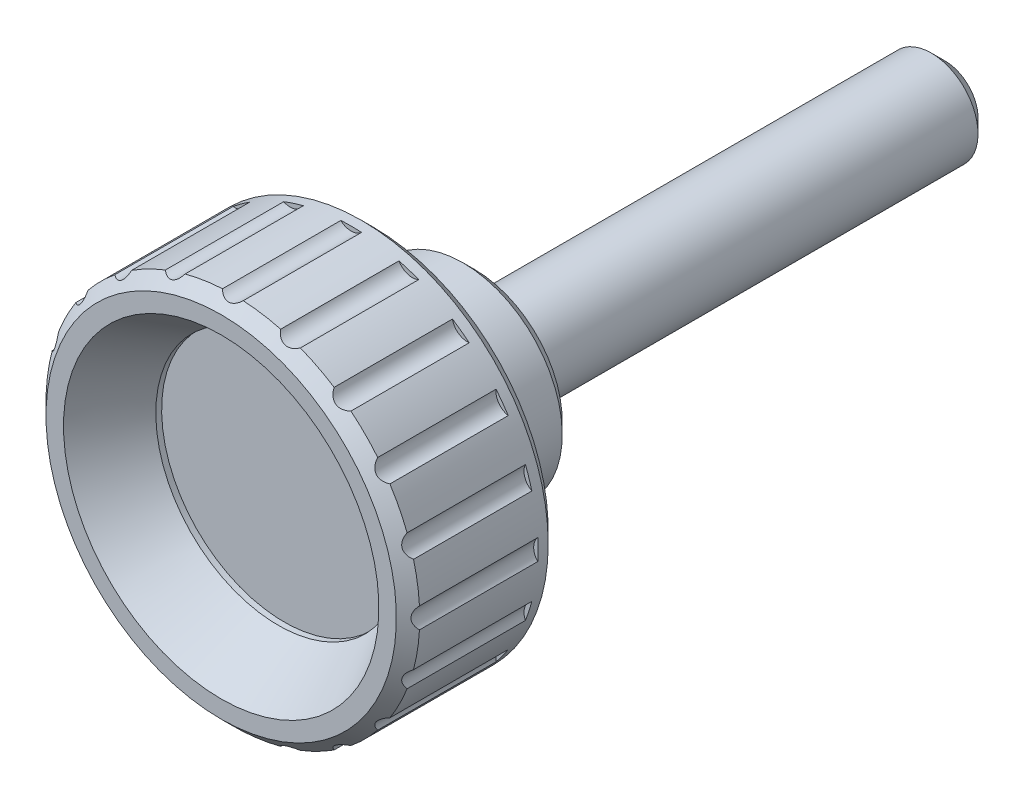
ISO-10303-21;
HEADER;
FILE_DESCRIPTION(('STEP AP214'),'2;1');
FILE_NAME('part.step','',(''),(''),'','','');
FILE_SCHEMA(('AUTOMOTIVE_DESIGN { 1 0 10303 214 1 1 1 1 }'));
ENDSEC;
DATA;
#1=APPLICATION_CONTEXT('core data for automotive mechanical design processes');
#2=APPLICATION_PROTOCOL_DEFINITION('international standard','automotive_design',2000,#1);
#3=PRODUCT_CONTEXT('',#1,'mechanical');
#4=PRODUCT('Part','Part','',(#3));
#5=PRODUCT_RELATED_PRODUCT_CATEGORY('part','',(#4));
#6=PRODUCT_DEFINITION_FORMATION('','',#4);
#7=PRODUCT_DEFINITION_CONTEXT('part definition',#1,'design');
#8=PRODUCT_DEFINITION('design','',#6,#7);
#9=PRODUCT_DEFINITION_SHAPE('','',#8);
#10=(LENGTH_UNIT() NAMED_UNIT(*) SI_UNIT(.MILLI.,.METRE.));
#11=(NAMED_UNIT(*) PLANE_ANGLE_UNIT() SI_UNIT($,.RADIAN.));
#12=(NAMED_UNIT(*) SI_UNIT($,.STERADIAN.) SOLID_ANGLE_UNIT());
#13=UNCERTAINTY_MEASURE_WITH_UNIT(LENGTH_MEASURE(1.E-05),#10,'distance_accuracy_value','');
#14=(GEOMETRIC_REPRESENTATION_CONTEXT(3) GLOBAL_UNCERTAINTY_ASSIGNED_CONTEXT((#13)) GLOBAL_UNIT_ASSIGNED_CONTEXT((#10,
#11,#12)) REPRESENTATION_CONTEXT('',''));
#15=CARTESIAN_POINT('',(0.,0.,0.));
#16=DIRECTION('',(0.,0.,1.));
#17=DIRECTION('',(1.,0.,0.));
#18=AXIS2_PLACEMENT_3D('',#15,#16,#17);
#19=CARTESIAN_POINT('',(0.,0.,0.));
#20=DIRECTION('',(0.,-3.55335756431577E-13,-1.));
#21=DIRECTION('',(0.,1.,-3.55335756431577E-13));
#22=AXIS2_PLACEMENT_3D('',#19,#20,#21);
#23=PLANE('',#22);
#24=CARTESIAN_POINT('',(0.,0.,0.));
#25=DIRECTION('',(0.,-3.55335756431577E-13,-1.));
#26=DIRECTION('',(0.,1.,-3.55335756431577E-13));
#27=AXIS2_PLACEMENT_3D('',#24,#25,#26);
#28=CIRCLE('',#27,5.);
#29=CARTESIAN_POINT('',(0.,5.,-1.77667878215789E-12));
#30=VERTEX_POINT('',#29);
#31=EDGE_CURVE('E1102',#30,#30,#28,.T.);
#32=ORIENTED_EDGE('',*,*,#31,.T.);
#33=EDGE_LOOP('',(#32));
#34=FACE_BOUND('',#33,.T.);
#35=CARTESIAN_POINT('',(0.,0.,0.));
#36=DIRECTION('',(0.,-3.55335756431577E-13,-1.));
#37=DIRECTION('',(0.,1.,-3.55335756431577E-13));
#38=AXIS2_PLACEMENT_3D('',#35,#36,#37);
#39=CIRCLE('',#38,4.);
#40=CARTESIAN_POINT('',(0.,4.,-1.42134302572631E-12));
#41=VERTEX_POINT('',#40);
#42=EDGE_CURVE('E1100',#41,#41,#39,.T.);
#43=ORIENTED_EDGE('',*,*,#42,.F.);
#44=EDGE_LOOP('',(#43));
#45=FACE_BOUND('',#44,.T.);
#46=ADVANCED_FACE('F14',(#34,#45),#23,.T.);
#47=CARTESIAN_POINT('',(-1.43127530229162E-12,7.46205088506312E-12,21.));
#48=DIRECTION('',(0.,-3.55335756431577E-13,-1.));
#49=DIRECTION('',(0.,1.,-3.55335756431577E-13));
#50=AXIS2_PLACEMENT_3D('',#47,#48,#49);
#51=CONICAL_SURFACE('',#50,16.,0.785398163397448);
#52=CARTESIAN_POINT('',(-1.49943126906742E-12,7.81738664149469E-12,22.));
#53=DIRECTION('',(0.,-3.55335756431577E-13,-1.));
#54=DIRECTION('',(0.,1.,-3.55335756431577E-13));
#55=AXIS2_PLACEMENT_3D('',#52,#53,#54);
#56=CIRCLE('',#55,15.);
#57=CARTESIAN_POINT('',(-1.49943126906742E-12,15.0000000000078,21.9999999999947));
#58=VERTEX_POINT('',#57);
#59=EDGE_CURVE('E582',#58,#58,#56,.T.);
#60=ORIENTED_EDGE('',*,*,#59,.T.);
#61=EDGE_LOOP('',(#60));
#62=FACE_BOUND('',#61,.T.);
#63=CARTESIAN_POINT('',(-1.43127530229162E-12,7.46205088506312E-12,21.));
#64=DIRECTION('',(0.,-3.55335756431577E-13,-1.));
#65=DIRECTION('',(0.,1.,-3.55335756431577E-13));
#66=AXIS2_PLACEMENT_3D('',#63,#64,#65);
#67=CIRCLE('',#66,16.);
#68=CARTESIAN_POINT('',(15.9753508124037,-0.887787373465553,21.0000000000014));
#69=VERTEX_POINT('',#68);
#70=CARTESIAN_POINT('',(15.4678028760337,-4.09231892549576,21.0000000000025));
#71=VERTEX_POINT('',#70);
#72=EDGE_CURVE('E587',#69,#71,#67,.T.);
#73=ORIENTED_EDGE('',*,*,#72,.F.);
#74=CARTESIAN_POINT('',(15.9755398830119,-0.887989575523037,20.9998000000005));
#75=CARTESIAN_POINT('',(15.9351784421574,-0.844826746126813,21.0424866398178));
#76=CARTESIAN_POINT('',(15.8966188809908,-0.797693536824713,21.0834537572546));
#77=CARTESIAN_POINT('',(15.8245769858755,-0.695019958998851,21.1602482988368));
#78=CARTESIAN_POINT('',(15.791150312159,-0.639398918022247,21.1960191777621));
#79=CARTESIAN_POINT('',(15.7380490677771,-0.532816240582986,21.2530008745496));
#80=CARTESIAN_POINT('',(15.7169614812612,-0.48337112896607,21.275690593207));
#81=CARTESIAN_POINT('',(15.6806455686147,-0.380207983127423,21.3148283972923));
#82=CARTESIAN_POINT('',(15.6653967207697,-0.326505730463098,21.3312983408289));
#83=CARTESIAN_POINT('',(15.6416857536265,-0.215315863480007,21.3569309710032));
#84=CARTESIAN_POINT('',(15.6332906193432,-0.157796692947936,21.366021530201));
#85=CARTESIAN_POINT('',(15.6243518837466,-0.0414082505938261,21.3757012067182));
#86=CARTESIAN_POINT('',(15.623808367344,0.0174610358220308,21.3762902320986));
#87=CARTESIAN_POINT('',(15.6301546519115,0.12624587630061,21.3694172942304));
#88=CARTESIAN_POINT('',(15.6360489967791,0.176295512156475,21.3630334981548));
#89=CARTESIAN_POINT('',(15.6532896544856,0.274274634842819,21.344383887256));
#90=CARTESIAN_POINT('',(15.6646343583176,0.322204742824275,21.33211980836));
#91=CARTESIAN_POINT('',(15.6925197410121,0.416525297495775,21.3020256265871));
#92=CARTESIAN_POINT('',(15.709218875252,0.462813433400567,21.2840259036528));
#93=CARTESIAN_POINT('',(15.7468524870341,0.551635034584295,21.2435491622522));
#94=CARTESIAN_POINT('',(15.7677958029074,0.594160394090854,21.2210628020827));
#95=CARTESIAN_POINT('',(15.8173070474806,0.682678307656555,21.168037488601));
#96=CARTESIAN_POINT('',(15.846568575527,0.727842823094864,21.1367787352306));
#97=CARTESIAN_POINT('',(15.9086393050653,0.812237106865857,21.0706895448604));
#98=CARTESIAN_POINT('',(15.9414255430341,0.851501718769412,21.0358822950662));
#99=CARTESIAN_POINT('',(15.9755398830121,0.887989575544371,20.9998));
#100=B_SPLINE_CURVE_WITH_KNOTS('',3,(#74,#75,#76,#77,#78,#79,#80,#81,#82,#83,#84,#85,#86,#87,
#88,#89,#90,#91,#92,#93,#94,#95,#96,#97,#98,#99),.UNSPECIFIED.,.F.,.F.,(4,2,2,2,2,2,2,2,2,2,2,2,
4),(0.,0.219100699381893,0.440431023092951,0.61478688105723,0.7885241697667,0.96393981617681,
1.13935735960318,1.29104866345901,1.44269521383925,1.59932369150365,1.75628175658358,
1.94245598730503,2.12748340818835),.UNSPECIFIED.);
#101=CARTESIAN_POINT('',(15.9753508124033,0.887787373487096,21.0000000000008));
#102=VERTEX_POINT('',#101);
#103=EDGE_CURVE('E588',#69,#102,#100,.T.);
#104=ORIENTED_EDGE('',*,*,#103,.T.);
#105=CARTESIAN_POINT('',(15.467802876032,4.09231892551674,20.9999999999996));
#106=VERTEX_POINT('',#105);
#107=EDGE_CURVE('E591',#106,#102,#67,.T.);
#108=ORIENTED_EDGE('',*,*,#107,.F.);
#109=CARTESIAN_POINT('',(15.4680028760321,4.09220841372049,20.9998349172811));
#110=CARTESIAN_POINT('',(15.4162815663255,4.12078731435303,21.0425185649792));
#111=CARTESIAN_POINT('',(15.3650471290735,4.15369881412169,21.0834826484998));
#112=CARTESIAN_POINT('',(15.2648091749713,4.22908574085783,21.1602711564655));
#113=CARTESIAN_POINT('',(15.2158336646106,4.27165508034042,21.1960390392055));
#114=CARTESIAN_POINT('',(15.1323998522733,4.35661227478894,21.2530163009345));
#115=CARTESIAN_POINT('',(15.0970664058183,4.39712151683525,21.2757043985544));
#116=CARTESIAN_POINT('',(15.030651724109,4.48401408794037,21.3148389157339));
#117=CARTESIAN_POINT('',(14.9995558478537,4.530376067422,21.3313071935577));
#118=CARTESIAN_POINT('',(14.9426490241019,4.62879687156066,21.3569365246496));
#119=CARTESIAN_POINT('',(14.9168920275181,4.68090639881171,21.3660254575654));
#120=CARTESIAN_POINT('',(14.8724279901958,4.78883525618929,21.3757021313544));
#121=CARTESIAN_POINT('',(14.8537210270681,4.84465462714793,21.3762897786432));
#122=CARTESIAN_POINT('',(14.8261428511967,4.95007522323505,21.3694146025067));
#123=CARTESIAN_POINT('',(14.8162835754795,4.9994964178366,21.363029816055));
#124=CARTESIAN_POINT('',(14.8024051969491,5.09800697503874,21.3443784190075));
#125=CARTESIAN_POINT('',(14.7983843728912,5.14709643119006,21.3321135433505));
#126=CARTESIAN_POINT('',(14.7957600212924,5.2454174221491,21.302017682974));
#127=CARTESIAN_POINT('',(14.7973389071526,5.29460058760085,21.2840169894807));
#128=CARTESIAN_POINT('',(14.8056849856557,5.39070462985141,21.243538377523));
#129=CARTESIAN_POINT('',(14.8124630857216,5.43762052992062,21.2210511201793));
#130=CARTESIAN_POINT('',(14.8321965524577,5.53709129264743,21.1680316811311));
#131=CARTESIAN_POINT('',(14.8460657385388,5.58907402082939,21.1367810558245));
#132=CARTESIAN_POINT('',(14.8790094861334,5.6884938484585,21.0707098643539));
#133=CARTESIAN_POINT('',(14.8980514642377,5.73595697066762,21.0359124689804));
#134=CARTESIAN_POINT('',(14.9192136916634,5.78119085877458,20.9998404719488));
#135=B_SPLINE_CURVE_WITH_KNOTS('',3,(#109,#110,#111,#112,#113,#114,#115,#116,#117,#118,#119,
#120,#121,#122,#123,#124,#125,#126,#127,#128,#129,#130,#131,#132,#133,#134),.UNSPECIFIED.,.F.,
.F.,(4,2,2,2,2,2,2,2,2,2,2,2,4),(0.,0.219090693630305,0.440410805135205,0.614763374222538,
0.788497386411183,0.963909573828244,1.13932369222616,1.29101393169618,1.44265944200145,
1.59928961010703,1.75624927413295,1.94237523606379,2.12735493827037),.UNSPECIFIED.);
#136=CARTESIAN_POINT('',(14.9191201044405,5.78099085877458,20.9999999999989));
#137=VERTEX_POINT('',#136);
#138=EDGE_CURVE('E276',#106,#137,#135,.T.);
#139=ORIENTED_EDGE('',*,*,#138,.T.);
#140=CARTESIAN_POINT('',(13.4461586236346,8.67184053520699,20.9999999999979));
#141=VERTEX_POINT('',#140);
#142=EDGE_CURVE('E594',#141,#137,#67,.T.);
#143=ORIENTED_EDGE('',*,*,#142,.F.);
#144=CARTESIAN_POINT('',(13.4463586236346,8.6718019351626,20.9998528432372));
#145=CARTESIAN_POINT('',(13.3883385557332,8.68300023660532,21.0425349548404));
#146=CARTESIAN_POINT('',(13.329442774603,8.69846942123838,21.0834974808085));
#147=CARTESIAN_POINT('',(13.2108177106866,8.73919269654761,21.1602828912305));
#148=CARTESIAN_POINT('',(13.151086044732,8.76454475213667,21.1960492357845));
#149=CARTESIAN_POINT('',(13.045484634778,8.81956217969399,21.2530242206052));
#150=CARTESIAN_POINT('',(12.9993630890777,8.84717062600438,21.275711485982));
#151=CARTESIAN_POINT('',(12.9093490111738,8.90928797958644,21.3148443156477));
#152=CARTESIAN_POINT('',(12.865449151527,8.94377205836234,21.3313117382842));
#153=CARTESIAN_POINT('',(12.7809154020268,9.0197911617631,21.3569393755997));
#154=CARTESIAN_POINT('',(12.7403171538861,9.06139107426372,21.3660274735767));
#155=CARTESIAN_POINT('',(12.6646792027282,9.15029744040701,21.3757026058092));
#156=CARTESIAN_POINT('',(12.6296395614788,9.19760395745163,21.3762895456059));
#157=CARTESIAN_POINT('',(12.5708357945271,9.28934266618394,21.3694132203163));
#158=CARTESIAN_POINT('',(12.5461876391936,9.33329835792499,21.3630279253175));
#159=CARTESIAN_POINT('',(12.5025481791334,9.42269874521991,21.3443756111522));
#160=CARTESIAN_POINT('',(12.4835552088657,9.46814299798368,21.3321103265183));
#161=CARTESIAN_POINT('',(12.4506773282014,9.56084100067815,21.3020136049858));
#162=CARTESIAN_POINT('',(12.4369809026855,9.6081051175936,21.2840124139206));
#163=CARTESIAN_POINT('',(12.4152215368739,9.70208497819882,21.2435328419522));
#164=CARTESIAN_POINT('',(12.4071705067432,9.7487993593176,21.2210451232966));
#165=CARTESIAN_POINT('',(12.3952016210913,9.84949409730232,21.168027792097));
#166=CARTESIAN_POINT('',(12.3923288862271,9.9032128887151,21.1367802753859));
#167=CARTESIAN_POINT('',(12.3929374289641,10.0079364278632,21.0707160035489));
#168=CARTESIAN_POINT('',(12.3963796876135,10.0589558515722,21.0359224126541));
#169=CARTESIAN_POINT('',(12.4025267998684,10.1085106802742,20.9998544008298));
#170=B_SPLINE_CURVE_WITH_KNOTS('',3,(#144,#145,#146,#147,#148,#149,#150,#151,#152,#153,#154,
#155,#156,#157,#158,#159,#160,#161,#162,#163,#164,#165,#166,#167,#168,#169),.UNSPECIFIED.,.F.,
.F.,(4,2,2,2,2,2,2,2,2,2,2,2,4),(0.,0.21908555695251,0.440400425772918,0.61475130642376,
0.788483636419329,0.963894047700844,1.1393064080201,1.29099610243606,1.4426410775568,
1.59927210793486,1.75623259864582,1.94233964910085,2.12730065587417),.UNSPECIFIED.);
#171=CARTESIAN_POINT('',(12.4025019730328,10.1083106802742,20.9999999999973));
#172=VERTEX_POINT('',#171);
#173=EDGE_CURVE('E517',#141,#172,#170,.T.);
#174=ORIENTED_EDGE('',*,*,#173,.T.);
#175=CARTESIAN_POINT('',(10.1083106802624,12.4025019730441,20.9999999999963));
#176=VERTEX_POINT('',#175);
#177=EDGE_CURVE('E1303',#176,#172,#67,.T.);
#178=ORIENTED_EDGE('',*,*,#177,.F.);
#179=CARTESIAN_POINT('',(10.1085106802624,12.4025267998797,20.9998544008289));
#180=CARTESIAN_POINT('',(10.0498699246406,12.3952479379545,21.042536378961));
#181=CARTESIAN_POINT('',(9.9890765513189,12.3917603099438,21.0834987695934));
#182=CARTESIAN_POINT('',(9.86367341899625,12.3938334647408,21.1602839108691));
#183=CARTESIAN_POINT('',(9.79903112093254,12.3994866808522,21.1960501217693));
#184=CARTESIAN_POINT('',(9.68159704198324,12.4191788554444,21.2530249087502));
#185=CARTESIAN_POINT('',(9.62920140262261,12.4311837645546,21.2757121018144));
#186=CARTESIAN_POINT('',(9.52439769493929,12.4624451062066,21.3148447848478));
#187=CARTESIAN_POINT('',(9.47199033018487,12.4816756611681,21.3313121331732));
#188=CARTESIAN_POINT('',(9.36810287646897,12.527851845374,21.3569396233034));
#189=CARTESIAN_POINT('',(9.31663663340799,12.5548702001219,21.3660276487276));
#190=CARTESIAN_POINT('',(9.21722722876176,12.6160518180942,21.3757026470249));
#191=CARTESIAN_POINT('',(9.16928410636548,12.6502151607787,21.3762895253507));
#192=CARTESIAN_POINT('',(9.08500969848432,12.7192925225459,21.3694131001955));
#193=CARTESIAN_POINT('',(9.04798489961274,12.7534801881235,21.3630277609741));
#194=CARTESIAN_POINT('',(8.97885516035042,12.825019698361,21.3443753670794));
#195=CARTESIAN_POINT('',(8.94674877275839,12.8623706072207,21.3321100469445));
#196=CARTESIAN_POINT('',(8.8868348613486,12.9403718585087,21.3020132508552));
#197=CARTESIAN_POINT('',(8.85920339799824,12.9810903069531,21.2840120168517));
#198=CARTESIAN_POINT('',(8.80946769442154,13.0637465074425,21.243532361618));
#199=CARTESIAN_POINT('',(8.78737520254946,13.1056866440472,21.2210446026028));
#200=CARTESIAN_POINT('',(8.74487571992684,13.1977546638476,21.1680270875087));
#201=CARTESIAN_POINT('',(8.72554355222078,13.247956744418,21.1367794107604));
#202=CARTESIAN_POINT('',(8.69376097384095,13.3477431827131,21.0707148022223));
#203=CARTESIAN_POINT('',(8.68126891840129,13.3973294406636,21.0359210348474));
#204=CARTESIAN_POINT('',(8.67180193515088,13.4463586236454,20.9998528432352));
#205=B_SPLINE_CURVE_WITH_KNOTS('',3,(#179,#180,#181,#182,#183,#184,#185,#186,#187,#188,#189,
#190,#191,#192,#193,#194,#195,#196,#197,#198,#199,#200,#201,#202,#203,#204),.UNSPECIFIED.,.F.,
.F.,(4,2,2,2,2,2,2,2,2,2,2,2,4),(0.,0.219085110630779,0.440399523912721,0.614750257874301,
0.788482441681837,0.963892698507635,1.13930490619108,1.29099455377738,1.44263948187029,
1.599270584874,1.75623114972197,1.94233892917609,2.12730065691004),.UNSPECIFIED.);
#206=CARTESIAN_POINT('',(8.67184053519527,13.4461586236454,20.9999999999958));
#207=VERTEX_POINT('',#206);
#208=EDGE_CURVE('E1293',#176,#207,#205,.T.);
#209=ORIENTED_EDGE('',*,*,#208,.T.);
#210=CARTESIAN_POINT('',(5.78099085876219,14.9191201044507,20.9999999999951));
#211=VERTEX_POINT('',#210);
#212=EDGE_CURVE('E601',#211,#207,#67,.T.);
#213=ORIENTED_EDGE('',*,*,#212,.F.);
#214=CARTESIAN_POINT('',(5.78119085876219,14.9192136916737,20.9998404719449));
#215=CARTESIAN_POINT('',(5.72766915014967,14.8941689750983,21.0425236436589));
#216=CARTESIAN_POINT('',(5.67092851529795,14.872064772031,21.0834872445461));
#217=CARTESIAN_POINT('',(5.5510212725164,14.8352827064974,21.1602747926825));
#218=CARTESIAN_POINT('',(5.48779515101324,14.8206827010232,21.1960421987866));
#219=CARTESIAN_POINT('',(5.37002254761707,14.8031204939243,21.2530187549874));
#220=CARTESIAN_POINT('',(5.31648146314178,14.7983461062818,21.2757065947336));
#221=CARTESIAN_POINT('',(5.20714649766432,14.7956901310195,21.3148405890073));
#222=CARTESIAN_POINT('',(5.15136128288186,14.7977841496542,21.3313086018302));
#223=CARTESIAN_POINT('',(5.03828848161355,14.8095962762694,21.3569374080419));
#224=CARTESIAN_POINT('',(4.98099158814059,14.8193878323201,21.3660260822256));
#225=CARTESIAN_POINT('',(4.86754042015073,14.8468549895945,21.3757022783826));
#226=CARTESIAN_POINT('',(4.81138615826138,14.8645306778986,21.3762897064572));
#227=CARTESIAN_POINT('',(4.7098894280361,14.9041843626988,21.3694141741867));
#228=CARTESIAN_POINT('',(4.66411184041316,14.9252571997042,21.3630292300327));
#229=CARTESIAN_POINT('',(4.5762579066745,14.971932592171,21.344377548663));
#230=CARTESIAN_POINT('',(4.53418047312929,14.9975338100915,21.3321125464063));
#231=CARTESIAN_POINT('',(4.45309476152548,15.0532024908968,21.3020164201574));
#232=CARTESIAN_POINT('',(4.41423284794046,15.0833891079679,21.2840155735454));
#233=CARTESIAN_POINT('',(4.3413888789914,15.1466300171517,21.2435366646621));
#234=CARTESIAN_POINT('',(4.30741726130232,15.1796902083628,21.2210492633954));
#235=CARTESIAN_POINT('',(4.2385424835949,15.2541231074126,21.1680291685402));
#236=CARTESIAN_POINT('',(4.20463940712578,15.2958988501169,21.136777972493));
#237=CARTESIAN_POINT('',(4.1435705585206,15.3809897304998,21.0707055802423));
#238=CARTESIAN_POINT('',(4.11636458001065,15.4242938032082,21.0359075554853));
#239=CARTESIAN_POINT('',(4.09220841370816,15.4680028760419,20.9998349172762));
#240=B_SPLINE_CURVE_WITH_KNOTS('',3,(#214,#215,#216,#217,#218,#219,#220,#221,#222,#223,#224,
#225,#226,#227,#228,#229,#230,#231,#232,#233,#234,#235,#236,#237,#238,#239),.UNSPECIFIED.,.F.,
.F.,(4,2,2,2,2,2,2,2,2,2,2,2,4),(0.,0.21908910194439,0.440407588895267,0.614759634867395,
0.78849312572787,0.963904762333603,1.13931833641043,1.29100840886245,1.44265375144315,
1.59928417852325,1.7562441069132,1.9423726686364,2.12735494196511),.UNSPECIFIED.);
#241=CARTESIAN_POINT('',(4.09231892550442,15.4678028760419,20.9999999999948));
#242=VERTEX_POINT('',#241);
#243=EDGE_CURVE('E1285',#211,#242,#240,.T.);
#244=ORIENTED_EDGE('',*,*,#243,.T.);
#245=CARTESIAN_POINT('',(0.887787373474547,15.9753508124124,20.9999999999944));
#246=VERTEX_POINT('',#245);
#247=EDGE_CURVE('E597',#246,#242,#67,.T.);
#248=ORIENTED_EDGE('',*,*,#247,.F.);
#249=CARTESIAN_POINT('',(0.887987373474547,15.9755378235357,20.9998021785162));
#250=CARTESIAN_POINT('',(0.844824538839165,15.9351765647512,21.0424886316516));
#251=CARTESIAN_POINT('',(0.797691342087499,15.8966171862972,21.0834555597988));
#252=CARTESIAN_POINT('',(0.695017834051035,15.8245756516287,21.1602497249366));
#253=CARTESIAN_POINT('',(0.639396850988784,15.7911491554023,21.1960204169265));
#254=CARTESIAN_POINT('',(0.532814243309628,15.7380481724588,21.2530018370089));
#255=CARTESIAN_POINT('',(0.483369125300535,15.716960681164,21.2756914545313));
#256=CARTESIAN_POINT('',(0.380205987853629,15.6806449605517,21.3148290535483));
#257=CARTESIAN_POINT('',(0.326503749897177,15.665396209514,21.3312988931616));
#258=CARTESIAN_POINT('',(0.215313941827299,15.6416854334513,21.3569313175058));
#259=CARTESIAN_POINT('',(0.157794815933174,15.6332903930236,21.3660217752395));
#260=CARTESIAN_POINT('',(0.0414064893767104,15.6243518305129,21.3757012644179));
#261=CARTESIAN_POINT('',(-0.0174627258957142,15.6238083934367,21.3762902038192));
#262=CARTESIAN_POINT('',(-0.1262474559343,15.6301548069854,21.3694171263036));
#263=CARTESIAN_POINT('',(-0.176297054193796,15.6360492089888,21.3630332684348));
#264=CARTESIAN_POINT('',(-0.274276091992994,15.6532899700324,21.3443835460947));
#265=CARTESIAN_POINT('',(-0.322206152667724,15.664634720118,21.332119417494));
#266=CARTESIAN_POINT('',(-0.416526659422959,15.6925202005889,21.3020251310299));
#267=CARTESIAN_POINT('',(-0.462814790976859,15.7092193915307,21.2840253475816));
#268=CARTESIAN_POINT('',(-0.551636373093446,15.7468531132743,21.2435484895));
#269=CARTESIAN_POINT('',(-0.594161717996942,15.7677964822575,21.2210620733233));
#270=CARTESIAN_POINT('',(-0.682678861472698,15.8173074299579,21.1680370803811));
#271=CARTESIAN_POINT('',(-0.72784270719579,15.8465685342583,21.1367787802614));
#272=CARTESIAN_POINT('',(-0.812235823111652,15.9086383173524,21.0706905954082));
#273=CARTESIAN_POINT('',(-0.851499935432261,15.9414240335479,21.0358838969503));
#274=CARTESIAN_POINT('',(-0.887987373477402,15.9755378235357,20.999802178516));
#275=B_SPLINE_CURVE_WITH_KNOTS('',3,(#249,#250,#251,#252,#253,#254,#255,#256,#257,#258,#259,
#260,#261,#262,#263,#264,#265,#266,#267,#268,#269,#270,#271,#272,#273,#274),.UNSPECIFIED.,.F.,
.F.,(4,2,2,2,2,2,2,2,2,2,2,2,4),(0.,0.219100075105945,0.440429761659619,0.614785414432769,
0.788522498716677,0.963937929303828,1.13935525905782,1.29104649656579,1.44269298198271,
1.59932156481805,1.75627972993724,1.94245124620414,2.12747598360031),.UNSPECIFIED.);
#276=CARTESIAN_POINT('',(-0.887787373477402,15.9753508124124,20.9999999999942));
#277=VERTEX_POINT('',#276);
#278=EDGE_CURVE('E1278',#246,#277,#275,.T.);
#279=ORIENTED_EDGE('',*,*,#278,.T.);
#280=CARTESIAN_POINT('',(-4.09231892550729,15.4678028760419,20.9999999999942));
#281=VERTEX_POINT('',#280);
#282=EDGE_CURVE('E602',#281,#277,#67,.T.);
#283=ORIENTED_EDGE('',*,*,#282,.F.);
#284=CARTESIAN_POINT('',(-4.09220841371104,15.4680028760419,20.9998349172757));
#285=CARTESIAN_POINT('',(-4.12078731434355,15.4162815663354,21.0425185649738));
#286=CARTESIAN_POINT('',(-4.15369881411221,15.3650471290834,21.0834826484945));
#287=CARTESIAN_POINT('',(-4.22908574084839,15.2648091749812,21.1602711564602));
#288=CARTESIAN_POINT('',(-4.271655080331,15.2158336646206,21.1960390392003));
#289=CARTESIAN_POINT('',(-4.35661227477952,15.1323998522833,21.2530163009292));
#290=CARTESIAN_POINT('',(-4.39712151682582,15.0970664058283,21.2757043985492));
#291=CARTESIAN_POINT('',(-4.48401408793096,15.0306517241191,21.3148389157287));
#292=CARTESIAN_POINT('',(-4.53037606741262,14.9995558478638,21.3313071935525));
#293=CARTESIAN_POINT('',(-4.6287968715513,14.942649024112,21.3569365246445));
#294=CARTESIAN_POINT('',(-4.68090639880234,14.9168920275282,21.3660254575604));
#295=CARTESIAN_POINT('',(-4.78883525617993,14.872427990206,21.3757021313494));
#296=CARTESIAN_POINT('',(-4.84465462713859,14.8537210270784,21.3762897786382));
#297=CARTESIAN_POINT('',(-4.95007522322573,14.826142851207,21.3694146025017));
#298=CARTESIAN_POINT('',(-4.99949641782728,14.8162835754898,21.3630298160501));
#299=CARTESIAN_POINT('',(-5.09800697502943,14.8024051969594,21.3443784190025));
#300=CARTESIAN_POINT('',(-5.14709643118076,14.7983843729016,21.3321135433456));
#301=CARTESIAN_POINT('',(-5.24541742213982,14.7957600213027,21.3020176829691));
#302=CARTESIAN_POINT('',(-5.29460058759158,14.797338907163,21.2840169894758));
#303=CARTESIAN_POINT('',(-5.39070462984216,14.805684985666,21.2435383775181));
#304=CARTESIAN_POINT('',(-5.43762052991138,14.8124630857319,21.2210511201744));
#305=CARTESIAN_POINT('',(-5.53709129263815,14.832196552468,21.1680316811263));
#306=CARTESIAN_POINT('',(-5.58907402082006,14.8460657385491,21.1367810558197));
#307=CARTESIAN_POINT('',(-5.68849384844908,14.8790094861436,21.0707098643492));
#308=CARTESIAN_POINT('',(-5.73595697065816,14.8980514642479,21.0359124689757));
#309=CARTESIAN_POINT('',(-5.78119085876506,14.9192136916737,20.9998404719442));
#310=B_SPLINE_CURVE_WITH_KNOTS('',3,(#284,#285,#286,#287,#288,#289,#290,#291,#292,#293,#294,
#295,#296,#297,#298,#299,#300,#301,#302,#303,#304,#305,#306,#307,#308,#309),.UNSPECIFIED.,.F.,
.F.,(4,2,2,2,2,2,2,2,2,2,2,2,4),(0.,0.219090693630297,0.440410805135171,0.614763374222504,
0.788497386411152,0.96390957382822,1.13932369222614,1.29101393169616,1.44265944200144,
1.59928961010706,1.75624927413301,1.94237523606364,2.12735493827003),.UNSPECIFIED.);
#311=CARTESIAN_POINT('',(-5.78099085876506,14.9191201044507,20.9999999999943));
#312=VERTEX_POINT('',#311);
#313=EDGE_CURVE('E1271',#281,#312,#310,.T.);
#314=ORIENTED_EDGE('',*,*,#313,.T.);
#315=CARTESIAN_POINT('',(-8.67184053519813,13.4461586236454,20.9999999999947));
#316=VERTEX_POINT('',#315);
#317=EDGE_CURVE('E1140',#316,#312,#67,.T.);
#318=ORIENTED_EDGE('',*,*,#317,.F.);
#319=CARTESIAN_POINT('',(-8.67180193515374,13.4463586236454,20.999852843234));
#320=CARTESIAN_POINT('',(-8.68300023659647,13.3883385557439,21.0425349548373));
#321=CARTESIAN_POINT('',(-8.69846942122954,13.3294427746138,21.0834974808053));
#322=CARTESIAN_POINT('',(-8.73919269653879,13.2108177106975,21.1602828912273));
#323=CARTESIAN_POINT('',(-8.76454475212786,13.1510860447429,21.1960492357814));
#324=CARTESIAN_POINT('',(-8.81956217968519,13.0454846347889,21.253024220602));
#325=CARTESIAN_POINT('',(-8.84717062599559,12.9993630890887,21.2757114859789));
#326=CARTESIAN_POINT('',(-8.90928797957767,12.9093490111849,21.3148443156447));
#327=CARTESIAN_POINT('',(-8.94377205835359,12.8654491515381,21.3313117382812));
#328=CARTESIAN_POINT('',(-9.01979116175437,12.780915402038,21.3569393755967));
#329=CARTESIAN_POINT('',(-9.06139107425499,12.7403171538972,21.3660274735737));
#330=CARTESIAN_POINT('',(-9.1502974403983,12.6646792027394,21.3757026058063));
#331=CARTESIAN_POINT('',(-9.19760395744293,12.62963956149,21.376289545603));
#332=CARTESIAN_POINT('',(-9.28934266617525,12.5708357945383,21.3694132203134));
#333=CARTESIAN_POINT('',(-9.3332983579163,12.5461876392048,21.3630279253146));
#334=CARTESIAN_POINT('',(-9.42269874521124,12.5025481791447,21.3443756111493));
#335=CARTESIAN_POINT('',(-9.46814299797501,12.483555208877,21.3321103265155));
#336=CARTESIAN_POINT('',(-9.56084100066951,12.4506773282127,21.302013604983));
#337=CARTESIAN_POINT('',(-9.60810511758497,12.4369809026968,21.2840124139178));
#338=CARTESIAN_POINT('',(-9.70208497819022,12.4152215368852,21.2435328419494));
#339=CARTESIAN_POINT('',(-9.74879935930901,12.4071705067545,21.2210451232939));
#340=CARTESIAN_POINT('',(-9.84949409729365,12.3952016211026,21.1680277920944));
#341=CARTESIAN_POINT('',(-9.90321288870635,12.3923288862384,21.1367802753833));
#342=CARTESIAN_POINT('',(-10.0079364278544,12.3929374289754,21.0707160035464));
#343=CARTESIAN_POINT('',(-10.0589558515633,12.3963796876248,21.0359224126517));
#344=CARTESIAN_POINT('',(-10.1085106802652,12.4025267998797,20.9998544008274));
#345=B_SPLINE_CURVE_WITH_KNOTS('',3,(#319,#320,#321,#322,#323,#324,#325,#326,#327,#328,#329,
#330,#331,#332,#333,#334,#335,#336,#337,#338,#339,#340,#341,#342,#343,#344),.UNSPECIFIED.,.F.,
.F.,(4,2,2,2,2,2,2,2,2,2,2,2,4),(0.,0.21908555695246,0.440400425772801,0.614751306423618,
0.78848363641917,0.96389404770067,1.13930640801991,1.29099610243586,1.4426410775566,
1.59927210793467,1.75623259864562,1.94233964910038,2.12730065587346),.UNSPECIFIED.);
#346=CARTESIAN_POINT('',(-10.1083106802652,12.4025019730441,20.9999999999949));
#347=VERTEX_POINT('',#346);
#348=EDGE_CURVE('E1264',#316,#347,#345,.T.);
#349=ORIENTED_EDGE('',*,*,#348,.T.);
#350=CARTESIAN_POINT('',(-12.402501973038,10.1083106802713,20.9999999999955));
#351=VERTEX_POINT('',#350);
#352=EDGE_CURVE('E1143',#351,#347,#67,.T.);
#353=ORIENTED_EDGE('',*,*,#352,.F.);
#354=CARTESIAN_POINT('',(-12.4025267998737,10.1085106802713,20.9998544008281));
#355=CARTESIAN_POINT('',(-12.3952479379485,10.0498699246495,21.0425363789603));
#356=CARTESIAN_POINT('',(-12.3917603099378,9.98907655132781,21.0834987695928));
#357=CARTESIAN_POINT('',(-12.3938334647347,9.86367341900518,21.1602839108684));
#358=CARTESIAN_POINT('',(-12.3994866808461,9.79903112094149,21.1960501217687));
#359=CARTESIAN_POINT('',(-12.4191788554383,9.6815970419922,21.2530249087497));
#360=CARTESIAN_POINT('',(-12.4311837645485,9.62920140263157,21.2757121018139));
#361=CARTESIAN_POINT('',(-12.4624451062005,9.52439769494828,21.3148447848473));
#362=CARTESIAN_POINT('',(-12.481675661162,9.47199033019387,21.3313121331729));
#363=CARTESIAN_POINT('',(-12.5278518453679,9.36810287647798,21.356939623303));
#364=CARTESIAN_POINT('',(-12.5548702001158,9.316636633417,21.3660276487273));
#365=CARTESIAN_POINT('',(-12.6160518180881,9.21722722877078,21.3757026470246));
#366=CARTESIAN_POINT('',(-12.6502151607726,9.1692841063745,21.3762895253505));
#367=CARTESIAN_POINT('',(-12.7192925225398,9.08500969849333,21.3694131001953));
#368=CARTESIAN_POINT('',(-12.7534801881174,9.04798489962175,21.363027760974));
#369=CARTESIAN_POINT('',(-12.8250196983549,8.97885516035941,21.3443753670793));
#370=CARTESIAN_POINT('',(-12.8623706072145,8.94674877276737,21.3321100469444));
#371=CARTESIAN_POINT('',(-12.9403718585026,8.88683486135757,21.3020132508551));
#372=CARTESIAN_POINT('',(-12.9810903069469,8.8592033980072,21.2840120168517));
#373=CARTESIAN_POINT('',(-13.0637465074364,8.8094676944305,21.243532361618));
#374=CARTESIAN_POINT('',(-13.1056866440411,8.78737520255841,21.2210446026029));
#375=CARTESIAN_POINT('',(-13.1977546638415,8.74487571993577,21.1680270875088));
#376=CARTESIAN_POINT('',(-13.247956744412,8.72554355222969,21.1367794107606));
#377=CARTESIAN_POINT('',(-13.347743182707,8.69376097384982,21.0707148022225));
#378=CARTESIAN_POINT('',(-13.3973294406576,8.68126891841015,21.0359210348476));
#379=CARTESIAN_POINT('',(-13.4463586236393,8.67180193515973,20.9998528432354));
#380=B_SPLINE_CURVE_WITH_KNOTS('',3,(#354,#355,#356,#357,#358,#359,#360,#361,#362,#363,#364,
#365,#366,#367,#368,#369,#370,#371,#372,#373,#374,#375,#376,#377,#378,#379),.UNSPECIFIED.,.F.,
.F.,(4,2,2,2,2,2,2,2,2,2,2,2,4),(0.,0.219085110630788,0.440399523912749,0.614750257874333,
0.788482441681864,0.963892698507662,1.13930490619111,1.29099455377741,1.44263948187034,
1.59927058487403,1.75623114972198,1.94233892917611,2.12730065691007),.UNSPECIFIED.);
#381=CARTESIAN_POINT('',(-13.4461586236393,8.67184053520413,20.999999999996));
#382=VERTEX_POINT('',#381);
#383=EDGE_CURVE('E1254',#351,#382,#380,.T.);
#384=ORIENTED_EDGE('',*,*,#383,.T.);
#385=CARTESIAN_POINT('',(-14.9191201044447,5.78099085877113,20.999999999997));
#386=VERTEX_POINT('',#385);
#387=EDGE_CURVE('E1146',#386,#382,#67,.T.);
#388=ORIENTED_EDGE('',*,*,#387,.F.);
#389=CARTESIAN_POINT('',(-14.9192136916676,5.78119085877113,20.9998404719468));
#390=CARTESIAN_POINT('',(-14.8941689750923,5.7276691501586,21.0425236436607));
#391=CARTESIAN_POINT('',(-14.8720647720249,5.6709285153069,21.0834872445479));
#392=CARTESIAN_POINT('',(-14.8352827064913,5.5510212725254,21.1602747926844));
#393=CARTESIAN_POINT('',(-14.8206827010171,5.48779515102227,21.1960421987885));
#394=CARTESIAN_POINT('',(-14.8031204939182,5.37002254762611,21.2530187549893));
#395=CARTESIAN_POINT('',(-14.7983461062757,5.31648146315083,21.2757065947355));
#396=CARTESIAN_POINT('',(-14.7956901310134,5.20714649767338,21.3148405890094));
#397=CARTESIAN_POINT('',(-14.797784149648,5.15136128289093,21.3313086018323));
#398=CARTESIAN_POINT('',(-14.8095962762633,5.03828848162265,21.356937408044));
#399=CARTESIAN_POINT('',(-14.819387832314,4.9809915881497,21.3660260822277));
#400=CARTESIAN_POINT('',(-14.8468549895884,4.86754042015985,21.3757022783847));
#401=CARTESIAN_POINT('',(-14.8645306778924,4.81138615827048,21.3762897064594));
#402=CARTESIAN_POINT('',(-14.9041843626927,4.70988942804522,21.369414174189));
#403=CARTESIAN_POINT('',(-14.9252571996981,4.66411184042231,21.363029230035));
#404=CARTESIAN_POINT('',(-14.9719325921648,4.57625790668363,21.3443775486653));
#405=CARTESIAN_POINT('',(-14.9975338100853,4.53418047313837,21.3321125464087));
#406=CARTESIAN_POINT('',(-15.0532024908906,4.45309476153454,21.3020164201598));
#407=CARTESIAN_POINT('',(-15.0833891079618,4.41423284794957,21.2840155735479));
#408=CARTESIAN_POINT('',(-15.1466300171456,4.3413888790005,21.2435366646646));
#409=CARTESIAN_POINT('',(-15.1796902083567,4.30741726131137,21.2210492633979));
#410=CARTESIAN_POINT('',(-15.2541231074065,4.2385424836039,21.1680291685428));
#411=CARTESIAN_POINT('',(-15.2958988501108,4.20463940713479,21.1367779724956));
#412=CARTESIAN_POINT('',(-15.3809897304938,4.14357055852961,21.0707055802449));
#413=CARTESIAN_POINT('',(-15.4242938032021,4.11636458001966,21.0359075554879));
#414=CARTESIAN_POINT('',(-15.4680028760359,4.0922084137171,20.9998349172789));
#415=B_SPLINE_CURVE_WITH_KNOTS('',3,(#389,#390,#391,#392,#393,#394,#395,#396,#397,#398,#399,
#400,#401,#402,#403,#404,#405,#406,#407,#408,#409,#410,#411,#412,#413,#414),.UNSPECIFIED.,.F.,
.F.,(4,2,2,2,2,2,2,2,2,2,2,2,4),(0.,0.219089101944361,0.440407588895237,0.614759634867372,
0.788493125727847,0.963904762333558,1.13931833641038,1.29100840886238,1.44265375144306,
1.59928417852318,1.75624410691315,1.94237266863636,2.12735494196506),.UNSPECIFIED.);
#416=CARTESIAN_POINT('',(-15.4678028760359,4.09231892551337,20.9999999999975));
#417=VERTEX_POINT('',#416);
#418=EDGE_CURVE('E1247',#386,#417,#415,.T.);
#419=ORIENTED_EDGE('',*,*,#418,.T.);
#420=CARTESIAN_POINT('',(-15.9753508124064,0.887787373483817,20.9999999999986));
#421=VERTEX_POINT('',#420);
#422=EDGE_CURVE('E1149',#421,#417,#67,.T.);
#423=ORIENTED_EDGE('',*,*,#422,.F.);
#424=CARTESIAN_POINT('',(-15.9755398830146,0.887989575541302,20.9997999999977));
#425=CARTESIAN_POINT('',(-15.9351784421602,0.84482674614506,21.042486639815));
#426=CARTESIAN_POINT('',(-15.8966188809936,0.797693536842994,21.0834537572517));
#427=CARTESIAN_POINT('',(-15.8245769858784,0.695019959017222,21.160248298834));
#428=CARTESIAN_POINT('',(-15.791150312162,0.639398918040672,21.1960191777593));
#429=CARTESIAN_POINT('',(-15.7380490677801,0.53281624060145,21.2530008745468));
#430=CARTESIAN_POINT('',(-15.7169614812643,0.483371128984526,21.2756905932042));
#431=CARTESIAN_POINT('',(-15.6806455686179,0.380207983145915,21.3148283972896));
#432=CARTESIAN_POINT('',(-15.6653967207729,0.326505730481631,21.3312983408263));
#433=CARTESIAN_POINT('',(-15.6416857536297,0.215315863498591,21.3569309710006));
#434=CARTESIAN_POINT('',(-15.6332906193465,0.157796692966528,21.3660215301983));
#435=CARTESIAN_POINT('',(-15.62435188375,0.0414082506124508,21.3757012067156));
#436=CARTESIAN_POINT('',(-15.6238083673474,-0.0174610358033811,21.376290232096));
#437=CARTESIAN_POINT('',(-15.6301546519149,-0.126245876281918,21.3694172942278));
#438=CARTESIAN_POINT('',(-15.6360489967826,-0.176295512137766,21.3630334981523));
#439=CARTESIAN_POINT('',(-15.6532896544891,-0.274274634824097,21.3443838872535));
#440=CARTESIAN_POINT('',(-15.6646343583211,-0.322204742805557,21.3321198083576));
#441=CARTESIAN_POINT('',(-15.6925197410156,-0.416525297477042,21.3020256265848));
#442=CARTESIAN_POINT('',(-15.7092188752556,-0.462813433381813,21.2840259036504));
#443=CARTESIAN_POINT('',(-15.7468524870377,-0.551635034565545,21.2435491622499));
#444=CARTESIAN_POINT('',(-15.767795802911,-0.594160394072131,21.2210628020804));
#445=CARTESIAN_POINT('',(-15.8173070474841,-0.682678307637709,21.1680374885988));
#446=CARTESIAN_POINT('',(-15.8465685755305,-0.727842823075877,21.1367787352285));
#447=CARTESIAN_POINT('',(-15.9086393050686,-0.812237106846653,21.0706895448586));
#448=CARTESIAN_POINT('',(-15.9414255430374,-0.851501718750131,21.0358822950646));
#449=CARTESIAN_POINT('',(-15.9755398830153,-0.887989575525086,20.9997999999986));
#450=B_SPLINE_CURVE_WITH_KNOTS('',3,(#424,#425,#426,#427,#428,#429,#430,#431,#432,#433,#434,
#435,#436,#437,#438,#439,#440,#441,#442,#443,#444,#445,#446,#447,#448,#449),.UNSPECIFIED.,.F.,
.F.,(4,2,2,2,2,2,2,2,2,2,2,2,4),(0.,0.219100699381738,0.440431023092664,0.614786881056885,
0.788524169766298,0.963939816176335,1.13935735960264,1.29104866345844,1.44269521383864,
1.59932369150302,1.75628175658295,1.94245598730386,2.12748340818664),.UNSPECIFIED.);
#451=CARTESIAN_POINT('',(-15.9753508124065,-0.887787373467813,20.9999999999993));
#452=VERTEX_POINT('',#451);
#453=EDGE_CURVE('E1240',#421,#452,#450,.T.);
#454=ORIENTED_EDGE('',*,*,#453,.T.);
#455=CARTESIAN_POINT('',(-15.467802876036,-4.09231892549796,21.0000000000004));
#456=VERTEX_POINT('',#455);
#457=EDGE_CURVE('E1152',#456,#452,#67,.T.);
#458=ORIENTED_EDGE('',*,*,#457,.F.);
#459=CARTESIAN_POINT('',(-15.468002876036,-4.09220841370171,20.9998349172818));
#460=CARTESIAN_POINT('',(-15.4162815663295,-4.12078731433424,21.04251856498));
#461=CARTESIAN_POINT('',(-15.3650471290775,-4.15369881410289,21.0834826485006));
#462=CARTESIAN_POINT('',(-15.2648091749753,-4.229085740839,21.1602711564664));
#463=CARTESIAN_POINT('',(-15.2158336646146,-4.27165508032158,21.1960390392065));
#464=CARTESIAN_POINT('',(-15.1323998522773,-4.35661227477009,21.2530163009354));
#465=CARTESIAN_POINT('',(-15.0970664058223,-4.39712151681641,21.2757043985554));
#466=CARTESIAN_POINT('',(-15.0306517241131,-4.48401408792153,21.314838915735));
#467=CARTESIAN_POINT('',(-14.9995558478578,-4.53037606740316,21.3313071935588));
#468=CARTESIAN_POINT('',(-14.942649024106,-4.62879687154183,21.3569365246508));
#469=CARTESIAN_POINT('',(-14.9168920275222,-4.68090639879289,21.3660254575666));
#470=CARTESIAN_POINT('',(-14.8724279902,-4.78883525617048,21.3757021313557));
#471=CARTESIAN_POINT('',(-14.8537210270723,-4.84465462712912,21.3762897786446));
#472=CARTESIAN_POINT('',(-14.8261428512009,-4.95007522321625,21.3694146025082));
#473=CARTESIAN_POINT('',(-14.8162835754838,-4.99949641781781,21.3630298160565));
#474=CARTESIAN_POINT('',(-14.8024051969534,-5.09800697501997,21.344378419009));
#475=CARTESIAN_POINT('',(-14.7983843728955,-5.14709643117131,21.332113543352));
#476=CARTESIAN_POINT('',(-14.7957600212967,-5.24541742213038,21.3020176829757));
#477=CARTESIAN_POINT('',(-14.797338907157,-5.29460058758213,21.2840169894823));
#478=CARTESIAN_POINT('',(-14.80568498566,-5.39070462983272,21.2435383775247));
#479=CARTESIAN_POINT('',(-14.8124630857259,-5.43762052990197,21.221051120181));
#480=CARTESIAN_POINT('',(-14.832196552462,-5.53709129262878,21.168031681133));
#481=CARTESIAN_POINT('',(-14.8460657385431,-5.5890740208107,21.1367810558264));
#482=CARTESIAN_POINT('',(-14.8790094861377,-5.68849384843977,21.0707098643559));
#483=CARTESIAN_POINT('',(-14.8980514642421,-5.73595697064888,21.0359124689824));
#484=CARTESIAN_POINT('',(-14.9192136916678,-5.78119085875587,20.9998404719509));
#485=B_SPLINE_CURVE_WITH_KNOTS('',3,(#459,#460,#461,#462,#463,#464,#465,#466,#467,#468,#469,
#470,#471,#472,#473,#474,#475,#476,#477,#478,#479,#480,#481,#482,#483,#484),.UNSPECIFIED.,.F.,
.F.,(4,2,2,2,2,2,2,2,2,2,2,2,4),(0.,0.219090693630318,0.440410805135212,0.614763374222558,
0.788497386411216,0.96390957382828,1.1393236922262,1.29101393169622,1.4426594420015,
1.5992896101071,1.75624927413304,1.94237523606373,2.12735493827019),.UNSPECIFIED.);
#486=CARTESIAN_POINT('',(-14.9191201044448,-5.78099085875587,21.0000000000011));
#487=VERTEX_POINT('',#486);
#488=EDGE_CURVE('E1233',#456,#487,#485,.T.);
#489=ORIENTED_EDGE('',*,*,#488,.T.);
#490=CARTESIAN_POINT('',(-13.4461586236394,-8.6718405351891,21.0000000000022));
#491=VERTEX_POINT('',#490);
#492=EDGE_CURVE('E1155',#491,#487,#67,.T.);
#493=ORIENTED_EDGE('',*,*,#492,.F.);
#494=CARTESIAN_POINT('',(-13.4463586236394,-8.67180193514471,20.9998528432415));
#495=CARTESIAN_POINT('',(-13.3883385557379,-8.68300023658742,21.0425349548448));
#496=CARTESIAN_POINT('',(-13.3294427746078,-8.69846942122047,21.0834974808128));
#497=CARTESIAN_POINT('',(-13.2108177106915,-8.73919269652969,21.1602828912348));
#498=CARTESIAN_POINT('',(-13.1510860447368,-8.76454475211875,21.1960492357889));
#499=CARTESIAN_POINT('',(-13.0454846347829,-8.81956217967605,21.2530242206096));
#500=CARTESIAN_POINT('',(-12.9993630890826,-8.84717062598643,21.2757114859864));
#501=CARTESIAN_POINT('',(-12.9093490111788,-8.9092879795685,21.3148443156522));
#502=CARTESIAN_POINT('',(-12.865449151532,-8.9437720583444,21.3313117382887));
#503=CARTESIAN_POINT('',(-12.7809154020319,-9.01979116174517,21.3569393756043));
#504=CARTESIAN_POINT('',(-12.7403171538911,-9.06139107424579,21.3660274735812));
#505=CARTESIAN_POINT('',(-12.6646792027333,-9.15029744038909,21.3757026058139));
#506=CARTESIAN_POINT('',(-12.6296395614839,-9.19760395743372,21.3762895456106));
#507=CARTESIAN_POINT('',(-12.5708357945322,-9.28934266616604,21.369413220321));
#508=CARTESIAN_POINT('',(-12.5461876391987,-9.3332983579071,21.3630279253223));
#509=CARTESIAN_POINT('',(-12.5025481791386,-9.42269874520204,21.344375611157));
#510=CARTESIAN_POINT('',(-12.4835552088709,-9.46814299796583,21.3321103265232));
#511=CARTESIAN_POINT('',(-12.4506773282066,-9.56084100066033,21.3020136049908));
#512=CARTESIAN_POINT('',(-12.4369809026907,-9.60810511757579,21.2840124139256));
#513=CARTESIAN_POINT('',(-12.4152215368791,-9.70208497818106,21.2435328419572));
#514=CARTESIAN_POINT('',(-12.4071705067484,-9.74879935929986,21.2210451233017));
#515=CARTESIAN_POINT('',(-12.3952016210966,-9.84949409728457,21.1680277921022));
#516=CARTESIAN_POINT('',(-12.3923288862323,-9.9032128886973,21.1367802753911));
#517=CARTESIAN_POINT('',(-12.3929374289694,-10.0079364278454,21.0707160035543));
#518=CARTESIAN_POINT('',(-12.3963796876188,-10.0589558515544,21.0359224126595));
#519=CARTESIAN_POINT('',(-12.4025267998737,-10.1085106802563,20.9998544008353));
#520=B_SPLINE_CURVE_WITH_KNOTS('',3,(#494,#495,#496,#497,#498,#499,#500,#501,#502,#503,#504,
#505,#506,#507,#508,#509,#510,#511,#512,#513,#514,#515,#516,#517,#518,#519),.UNSPECIFIED.,.F.,
.F.,(4,2,2,2,2,2,2,2,2,2,2,2,4),(0.,0.219085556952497,0.440400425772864,0.614751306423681,
0.788483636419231,0.963894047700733,1.13930640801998,1.29099610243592,1.44264107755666,
1.59927210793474,1.7562325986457,1.94233964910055,2.12730065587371),.UNSPECIFIED.);
#521=CARTESIAN_POINT('',(-12.402501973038,-10.1083106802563,21.0000000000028));
#522=VERTEX_POINT('',#521);
#523=EDGE_CURVE('E1223',#491,#522,#520,.T.);
#524=ORIENTED_EDGE('',*,*,#523,.T.);
#525=CARTESIAN_POINT('',(-10.108310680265,-12.4025019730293,21.0000000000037));
#526=VERTEX_POINT('',#525);
#527=EDGE_CURVE('E1158',#526,#522,#67,.T.);
#528=ORIENTED_EDGE('',*,*,#527,.F.);
#529=CARTESIAN_POINT('',(-10.108510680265,-12.4025267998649,20.9998544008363));
#530=CARTESIAN_POINT('',(-10.0498699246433,-12.3952479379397,21.0425363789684));
#531=CARTESIAN_POINT('',(-9.98907655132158,-12.391760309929,21.0834987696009));
#532=CARTESIAN_POINT('',(-9.86367341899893,-12.3938334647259,21.1602839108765));
#533=CARTESIAN_POINT('',(-9.79903112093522,-12.3994866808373,21.1960501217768));
#534=CARTESIAN_POINT('',(-9.68159704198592,-12.4191788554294,21.2530249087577));
#535=CARTESIAN_POINT('',(-9.62920140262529,-12.4311837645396,21.2757121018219));
#536=CARTESIAN_POINT('',(-9.52439769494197,-12.4624451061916,21.3148447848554));
#537=CARTESIAN_POINT('',(-9.47199033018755,-12.481675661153,21.3313121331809));
#538=CARTESIAN_POINT('',(-9.36810287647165,-12.5278518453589,21.3569396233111));
#539=CARTESIAN_POINT('',(-9.31663663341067,-12.5548702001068,21.3660276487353));
#540=CARTESIAN_POINT('',(-9.21722722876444,-12.6160518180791,21.3757026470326));
#541=CARTESIAN_POINT('',(-9.16928410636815,-12.6502151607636,21.3762895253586));
#542=CARTESIAN_POINT('',(-9.08500969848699,-12.7192925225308,21.3694131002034));
#543=CARTESIAN_POINT('',(-9.04798489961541,-12.7534801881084,21.363027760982));
#544=CARTESIAN_POINT('',(-8.97885516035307,-12.8250196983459,21.3443753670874));
#545=CARTESIAN_POINT('',(-8.94674877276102,-12.8623706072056,21.3321100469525));
#546=CARTESIAN_POINT('',(-8.88683486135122,-12.9403718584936,21.3020132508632));
#547=CARTESIAN_POINT('',(-8.85920339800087,-12.981090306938,21.2840120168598));
#548=CARTESIAN_POINT('',(-8.80946769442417,-13.0637465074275,21.2435323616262));
#549=CARTESIAN_POINT('',(-8.78737520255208,-13.1056866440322,21.2210446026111));
#550=CARTESIAN_POINT('',(-8.74487571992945,-13.1977546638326,21.1680270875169));
#551=CARTESIAN_POINT('',(-8.72554355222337,-13.2479567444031,21.1367794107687));
#552=CARTESIAN_POINT('',(-8.6937609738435,-13.3477431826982,21.0707148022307));
#553=CARTESIAN_POINT('',(-8.68126891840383,-13.3973294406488,21.0359210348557));
#554=CARTESIAN_POINT('',(-8.67180193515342,-13.4463586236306,20.9998528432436));
#555=B_SPLINE_CURVE_WITH_KNOTS('',3,(#529,#530,#531,#532,#533,#534,#535,#536,#537,#538,#539,
#540,#541,#542,#543,#544,#545,#546,#547,#548,#549,#550,#551,#552,#553,#554),.UNSPECIFIED.,.F.,
.F.,(4,2,2,2,2,2,2,2,2,2,2,2,4),(0.,0.219085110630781,0.440399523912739,0.614750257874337,
0.788482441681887,0.963892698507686,1.13930490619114,1.29099455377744,1.44263948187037,
1.59927058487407,1.75623114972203,1.94233892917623,2.12730065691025),.UNSPECIFIED.);
#556=CARTESIAN_POINT('',(-8.67184053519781,-13.4461586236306,21.0000000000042));
#557=VERTEX_POINT('',#556);
#558=EDGE_CURVE('E1216',#526,#557,#555,.T.);
#559=ORIENTED_EDGE('',*,*,#558,.T.);
#560=CARTESIAN_POINT('',(-5.78099085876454,-14.919120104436,21.0000000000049));
#561=VERTEX_POINT('',#560);
#562=EDGE_CURVE('E1161',#561,#557,#67,.T.);
#563=ORIENTED_EDGE('',*,*,#562,.F.);
#564=CARTESIAN_POINT('',(-5.78119085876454,-14.919213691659,20.9998404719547));
#565=CARTESIAN_POINT('',(-5.72766915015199,-14.8941689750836,21.0425236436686));
#566=CARTESIAN_POINT('',(-5.67092851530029,-14.8720647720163,21.0834872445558));
#567=CARTESIAN_POINT('',(-5.55102127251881,-14.8352827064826,21.1602747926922));
#568=CARTESIAN_POINT('',(-5.48779515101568,-14.8206827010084,21.1960421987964));
#569=CARTESIAN_POINT('',(-5.37002254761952,-14.8031204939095,21.2530187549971));
#570=CARTESIAN_POINT('',(-5.31648146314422,-14.798346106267,21.2757065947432));
#571=CARTESIAN_POINT('',(-5.20714649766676,-14.7956901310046,21.314840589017));
#572=CARTESIAN_POINT('',(-5.15136128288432,-14.7977841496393,21.33130860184));
#573=CARTESIAN_POINT('',(-5.03828848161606,-14.8095962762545,21.3569374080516));
#574=CARTESIAN_POINT('',(-4.98099158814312,-14.8193878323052,21.3660260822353));
#575=CARTESIAN_POINT('',(-4.86754042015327,-14.8468549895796,21.3757022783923));
#576=CARTESIAN_POINT('',(-4.8113861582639,-14.8645306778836,21.3762897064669));
#577=CARTESIAN_POINT('',(-4.70988942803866,-14.9041843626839,21.3694141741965));
#578=CARTESIAN_POINT('',(-4.66411184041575,-14.9252571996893,21.3630292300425));
#579=CARTESIAN_POINT('',(-4.57625790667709,-14.9719325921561,21.3443775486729));
#580=CARTESIAN_POINT('',(-4.53418047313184,-14.9975338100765,21.3321125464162));
#581=CARTESIAN_POINT('',(-4.45309476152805,-15.0532024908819,21.3020164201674));
#582=CARTESIAN_POINT('',(-4.41423284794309,-15.083389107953,21.2840155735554));
#583=CARTESIAN_POINT('',(-4.34138887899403,-15.1466300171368,21.2435366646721));
#584=CARTESIAN_POINT('',(-4.30741726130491,-15.1796902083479,21.2210492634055));
#585=CARTESIAN_POINT('',(-4.23854248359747,-15.2541231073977,21.1680291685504));
#586=CARTESIAN_POINT('',(-4.2046394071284,-15.295898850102,21.1367779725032));
#587=CARTESIAN_POINT('',(-4.14357055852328,-15.380989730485,21.0707055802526));
#588=CARTESIAN_POINT('',(-4.11636458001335,-15.4242938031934,21.0359075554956));
#589=CARTESIAN_POINT('',(-4.09220841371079,-15.4680028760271,20.9998349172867));
#590=B_SPLINE_CURVE_WITH_KNOTS('',3,(#564,#565,#566,#567,#568,#569,#570,#571,#572,#573,#574,
#575,#576,#577,#578,#579,#580,#581,#582,#583,#584,#585,#586,#587,#588,#589),.UNSPECIFIED.,.F.,
.F.,(4,2,2,2,2,2,2,2,2,2,2,2,4),(0.,0.219089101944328,0.440407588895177,0.614759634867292,
0.788493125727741,0.963904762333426,1.13931833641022,1.29100840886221,1.44265375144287,
1.59928417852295,1.75624410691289,1.94237266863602,2.12735494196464),.UNSPECIFIED.);
#591=CARTESIAN_POINT('',(-4.09231892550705,-15.4678028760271,21.0000000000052));
#592=VERTEX_POINT('',#591);
#593=EDGE_CURVE('E1209',#561,#592,#590,.T.);
#594=ORIENTED_EDGE('',*,*,#593,.T.);
#595=CARTESIAN_POINT('',(-0.887787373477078,-15.9753508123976,21.0000000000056));
#596=VERTEX_POINT('',#595);
#597=EDGE_CURVE('E1164',#596,#592,#67,.T.);
#598=ORIENTED_EDGE('',*,*,#597,.F.);
#599=CARTESIAN_POINT('',(-0.88798737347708,-15.9755378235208,20.9998021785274));
#600=CARTESIAN_POINT('',(-0.844824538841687,-15.9351765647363,21.0424886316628));
#601=CARTESIAN_POINT('',(-0.797691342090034,-15.8966171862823,21.0834555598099));
#602=CARTESIAN_POINT('',(-0.695017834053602,-15.8245756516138,21.1602497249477));
#603=CARTESIAN_POINT('',(-0.63939685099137,-15.7911491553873,21.1960204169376));
#604=CARTESIAN_POINT('',(-0.532814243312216,-15.7380481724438,21.2530018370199));
#605=CARTESIAN_POINT('',(-0.483369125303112,-15.716960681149,21.2756914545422));
#606=CARTESIAN_POINT('',(-0.380205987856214,-15.6806449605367,21.3148290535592));
#607=CARTESIAN_POINT('',(-0.32650374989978,-15.665396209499,21.3312988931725));
#608=CARTESIAN_POINT('',(-0.215313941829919,-15.6416854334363,21.3569313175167));
#609=CARTESIAN_POINT('',(-0.157794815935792,-15.6332903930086,21.3660217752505));
#610=CARTESIAN_POINT('',(-0.0414064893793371,-15.6243518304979,21.3757012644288));
#611=CARTESIAN_POINT('',(0.0174627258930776,-15.6238083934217,21.3762902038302));
#612=CARTESIAN_POINT('',(0.126247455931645,-15.6301548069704,21.3694171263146));
#613=CARTESIAN_POINT('',(0.176297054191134,-15.6360492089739,21.3630332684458));
#614=CARTESIAN_POINT('',(0.274276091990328,-15.6532899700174,21.3443835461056));
#615=CARTESIAN_POINT('',(0.322206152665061,-15.664634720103,21.332119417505));
#616=CARTESIAN_POINT('',(0.416526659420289,-15.692520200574,21.3020251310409));
#617=CARTESIAN_POINT('',(0.462814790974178,-15.7092193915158,21.2840253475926));
#618=CARTESIAN_POINT('',(0.55163637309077,-15.7468531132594,21.243548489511));
#619=CARTESIAN_POINT('',(0.594161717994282,-15.7677964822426,21.2210620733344));
#620=CARTESIAN_POINT('',(0.682678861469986,-15.817307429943,21.1680370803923));
#621=CARTESIAN_POINT('',(0.727842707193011,-15.8465685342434,21.1367787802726));
#622=CARTESIAN_POINT('',(0.81223582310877,-15.9086383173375,21.0706905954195));
#623=CARTESIAN_POINT('',(0.851499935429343,-15.941424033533,21.0358838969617));
#624=CARTESIAN_POINT('',(0.88798737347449,-15.9755378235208,20.9998021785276));
#625=B_SPLINE_CURVE_WITH_KNOTS('',3,(#599,#600,#601,#602,#603,#604,#605,#606,#607,#608,#609,
#610,#611,#612,#613,#614,#615,#616,#617,#618,#619,#620,#621,#622,#623,#624),.UNSPECIFIED.,.F.,
.F.,(4,2,2,2,2,2,2,2,2,2,2,2,4),(0.,0.219100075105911,0.44042976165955,0.614785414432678,
0.788522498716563,0.963937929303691,1.13935525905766,1.29104649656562,1.44269298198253,
1.59932156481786,1.75627972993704,1.94245124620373,2.1274759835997),.UNSPECIFIED.);
#626=CARTESIAN_POINT('',(0.887787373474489,-15.9753508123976,21.0000000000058));
#627=VERTEX_POINT('',#626);
#628=EDGE_CURVE('E1183',#596,#627,#625,.T.);
#629=ORIENTED_EDGE('',*,*,#628,.T.);
#630=CARTESIAN_POINT('',(4.09231892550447,-15.4678028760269,21.0000000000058));
#631=VERTEX_POINT('',#630);
#632=EDGE_CURVE('E1167',#631,#627,#67,.T.);
#633=ORIENTED_EDGE('',*,*,#632,.F.);
#634=CARTESIAN_POINT('',(4.09220841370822,-15.468002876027,20.9998349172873));
#635=CARTESIAN_POINT('',(4.12078731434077,-15.4162815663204,21.0425185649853));
#636=CARTESIAN_POINT('',(4.15369881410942,-15.3650471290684,21.083482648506));
#637=CARTESIAN_POINT('',(4.22908574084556,-15.2648091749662,21.1602711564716));
#638=CARTESIAN_POINT('',(4.27165508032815,-15.2158336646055,21.1960390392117));
#639=CARTESIAN_POINT('',(4.35661227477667,-15.1323998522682,21.2530163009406));
#640=CARTESIAN_POINT('',(4.397121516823,-15.0970664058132,21.2757043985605));
#641=CARTESIAN_POINT('',(4.48401408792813,-15.030651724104,21.31483891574));
#642=CARTESIAN_POINT('',(4.53037606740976,-14.9995558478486,21.3313071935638));
#643=CARTESIAN_POINT('',(4.62879687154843,-14.9426490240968,21.3569365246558));
#644=CARTESIAN_POINT('',(4.68090639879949,-14.9168920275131,21.3660254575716));
#645=CARTESIAN_POINT('',(4.78883525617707,-14.8724279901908,21.3757021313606));
#646=CARTESIAN_POINT('',(4.84465462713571,-14.8537210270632,21.3762897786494));
#647=CARTESIAN_POINT('',(4.95007522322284,-14.8261428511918,21.3694146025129));
#648=CARTESIAN_POINT('',(4.9994964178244,-14.8162835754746,21.3630298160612));
#649=CARTESIAN_POINT('',(5.09800697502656,-14.8024051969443,21.3443784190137));
#650=CARTESIAN_POINT('',(5.1470964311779,-14.7983843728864,21.3321135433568));
#651=CARTESIAN_POINT('',(5.24541742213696,-14.7957600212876,21.3020176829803));
#652=CARTESIAN_POINT('',(5.29460058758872,-14.7973389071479,21.284016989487));
#653=CARTESIAN_POINT('',(5.39070462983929,-14.8056849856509,21.2435383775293));
#654=CARTESIAN_POINT('',(5.43762052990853,-14.8124630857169,21.2210511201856));
#655=CARTESIAN_POINT('',(5.5370912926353,-14.832196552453,21.1680316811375));
#656=CARTESIAN_POINT('',(5.5890740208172,-14.8460657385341,21.136781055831));
#657=CARTESIAN_POINT('',(5.68849384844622,-14.8790094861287,21.0707098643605));
#658=CARTESIAN_POINT('',(5.73595697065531,-14.898051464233,21.0359124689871));
#659=CARTESIAN_POINT('',(5.78119085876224,-14.9192136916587,20.9998404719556));
#660=B_SPLINE_CURVE_WITH_KNOTS('',3,(#634,#635,#636,#637,#638,#639,#640,#641,#642,#643,#644,
#645,#646,#647,#648,#649,#650,#651,#652,#653,#654,#655,#656,#657,#658,#659),.UNSPECIFIED.,.F.,
.F.,(4,2,2,2,2,2,2,2,2,2,2,2,4),(0.,0.219090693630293,0.440410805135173,0.614763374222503,
0.78849738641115,0.963909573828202,1.13932369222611,1.29101393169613,1.44265944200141,
1.59928961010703,1.75624927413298,1.9423752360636,2.12735493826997),.UNSPECIFIED.);
#661=CARTESIAN_POINT('',(5.78099085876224,-14.9191201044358,21.0000000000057));
#662=VERTEX_POINT('',#661);
#663=EDGE_CURVE('E1181',#631,#662,#660,.T.);
#664=ORIENTED_EDGE('',*,*,#663,.T.);
#665=CARTESIAN_POINT('',(8.67184053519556,-13.4461586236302,21.0000000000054));
#666=VERTEX_POINT('',#665);
#667=EDGE_CURVE('E1170',#666,#662,#67,.T.);
#668=ORIENTED_EDGE('',*,*,#667,.F.);
#669=CARTESIAN_POINT('',(8.67180193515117,-13.4463586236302,20.9998528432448));
#670=CARTESIAN_POINT('',(8.68300023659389,-13.3883385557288,21.0425349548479));
#671=CARTESIAN_POINT('',(8.69846942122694,-13.3294427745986,21.083497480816));
#672=CARTESIAN_POINT('',(8.73919269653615,-13.2108177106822,21.160282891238));
#673=CARTESIAN_POINT('',(8.76454475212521,-13.1510860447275,21.196049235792));
#674=CARTESIAN_POINT('',(8.81956217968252,-13.0454846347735,21.2530242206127));
#675=CARTESIAN_POINT('',(8.84717062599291,-12.9993630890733,21.2757114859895));
#676=CARTESIAN_POINT('',(8.90928797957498,-12.9093490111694,21.3148443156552));
#677=CARTESIAN_POINT('',(8.94377205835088,-12.8654491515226,21.3313117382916));
#678=CARTESIAN_POINT('',(9.01979116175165,-12.7809154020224,21.3569393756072));
#679=CARTESIAN_POINT('',(9.06139107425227,-12.7403171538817,21.3660274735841));
#680=CARTESIAN_POINT('',(9.15029744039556,-12.6646792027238,21.3757026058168));
#681=CARTESIAN_POINT('',(9.19760395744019,-12.6296395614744,21.3762895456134));
#682=CARTESIAN_POINT('',(9.28934266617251,-12.5708357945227,21.3694132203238));
#683=CARTESIAN_POINT('',(9.33329835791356,-12.5461876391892,21.363027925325));
#684=CARTESIAN_POINT('',(9.42269874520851,-12.5025481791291,21.3443756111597));
#685=CARTESIAN_POINT('',(9.4681429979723,-12.4835552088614,21.332110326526));
#686=CARTESIAN_POINT('',(9.56084100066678,-12.450677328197,21.3020136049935));
#687=CARTESIAN_POINT('',(9.60810511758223,-12.4369809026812,21.2840124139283));
#688=CARTESIAN_POINT('',(9.70208497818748,-12.4152215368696,21.2435328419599));
#689=CARTESIAN_POINT('',(9.74879935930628,-12.4071705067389,21.2210451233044));
#690=CARTESIAN_POINT('',(9.84949409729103,-12.3952016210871,21.1680277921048));
#691=CARTESIAN_POINT('',(9.90321288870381,-12.3923288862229,21.1367802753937));
#692=CARTESIAN_POINT('',(10.007936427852,-12.3929374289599,21.0707160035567));
#693=CARTESIAN_POINT('',(10.058955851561,-12.3963796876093,21.0359224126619));
#694=CARTESIAN_POINT('',(10.108510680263,-12.4025267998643,20.9998544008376));
#695=B_SPLINE_CURVE_WITH_KNOTS('',3,(#669,#670,#671,#672,#673,#674,#675,#676,#677,#678,#679,
#680,#681,#682,#683,#684,#685,#686,#687,#688,#689,#690,#691,#692,#693,#694),.UNSPECIFIED.,.F.,
.F.,(4,2,2,2,2,2,2,2,2,2,2,2,4),(0.,0.219085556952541,0.440400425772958,0.614751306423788,
0.788483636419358,0.963894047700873,1.13930640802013,1.29099610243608,1.44264107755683,
1.59927210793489,1.75623259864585,1.9423396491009,2.12730065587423),.UNSPECIFIED.);
#696=CARTESIAN_POINT('',(10.108310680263,-12.4025019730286,21.0000000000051));
#697=VERTEX_POINT('',#696);
#698=EDGE_CURVE('E1179',#666,#697,#695,.T.);
#699=ORIENTED_EDGE('',*,*,#698,.T.);
#700=CARTESIAN_POINT('',(12.4025019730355,-10.108310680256,21.0000000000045));
#701=VERTEX_POINT('',#700);
#702=EDGE_CURVE('E596',#701,#697,#67,.T.);
#703=ORIENTED_EDGE('',*,*,#702,.F.);
#704=CARTESIAN_POINT('',(12.4025267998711,-10.108510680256,20.999854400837));
#705=CARTESIAN_POINT('',(12.3952479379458,-10.0498699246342,21.0425363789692));
#706=CARTESIAN_POINT('',(12.3917603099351,-9.98907655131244,21.0834987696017));
#707=CARTESIAN_POINT('',(12.393833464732,-9.86367341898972,21.1602839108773));
#708=CARTESIAN_POINT('',(12.3994866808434,-9.79903112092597,21.1960501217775));
#709=CARTESIAN_POINT('',(12.4191788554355,-9.68159704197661,21.2530249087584));
#710=CARTESIAN_POINT('',(12.4311837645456,-9.62920140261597,21.2757121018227));
#711=CARTESIAN_POINT('',(12.4624451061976,-9.52439769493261,21.3148447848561));
#712=CARTESIAN_POINT('',(12.4816756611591,-9.47199033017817,21.3313121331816));
#713=CARTESIAN_POINT('',(12.5278518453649,-9.36810287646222,21.3569396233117));
#714=CARTESIAN_POINT('',(12.5548702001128,-9.31663663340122,21.366027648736));
#715=CARTESIAN_POINT('',(12.6160518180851,-9.21722722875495,21.3757026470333));
#716=CARTESIAN_POINT('',(12.6502151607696,-9.16928410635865,21.3762895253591));
#717=CARTESIAN_POINT('',(12.7192925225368,-9.08500969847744,21.369413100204));
#718=CARTESIAN_POINT('',(12.7534801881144,-9.04798489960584,21.3630277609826));
#719=CARTESIAN_POINT('',(12.8250196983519,-8.97885516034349,21.3443753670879));
#720=CARTESIAN_POINT('',(12.8623706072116,-8.94674877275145,21.332110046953));
#721=CARTESIAN_POINT('',(12.9403718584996,-8.88683486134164,21.3020132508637));
#722=CARTESIAN_POINT('',(12.981090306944,-8.85920339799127,21.2840120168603));
#723=CARTESIAN_POINT('',(13.0637465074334,-8.80946769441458,21.2435323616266));
#724=CARTESIAN_POINT('',(13.1056866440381,-8.7873752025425,21.2210446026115));
#725=CARTESIAN_POINT('',(13.1977546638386,-8.74487571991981,21.1680270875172));
#726=CARTESIAN_POINT('',(13.2479567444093,-8.72554355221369,21.136779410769));
#727=CARTESIAN_POINT('',(13.3477431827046,-8.69376097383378,21.0707148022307));
#728=CARTESIAN_POINT('',(13.3973294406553,-8.6812689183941,21.0359210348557));
#729=CARTESIAN_POINT('',(13.4463586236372,-8.67180193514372,20.9998528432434));
#730=B_SPLINE_CURVE_WITH_KNOTS('',3,(#704,#705,#706,#707,#708,#709,#710,#711,#712,#713,#714,
#715,#716,#717,#718,#719,#720,#721,#722,#723,#724,#725,#726,#727,#728,#729),.UNSPECIFIED.,.F.,
.F.,(4,2,2,2,2,2,2,2,2,2,2,2,4),(0.,0.219085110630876,0.440399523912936,0.614750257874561,
0.788482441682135,0.963892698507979,1.13930490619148,1.2909945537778,1.44263948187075,
1.59927058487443,1.75623114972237,1.94233892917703,2.1273006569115),.UNSPECIFIED.);
#731=CARTESIAN_POINT('',(13.4461586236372,-8.67184053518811,21.000000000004));
#732=VERTEX_POINT('',#731);
#733=EDGE_CURVE('E1178',#701,#732,#730,.T.);
#734=ORIENTED_EDGE('',*,*,#733,.T.);
#735=CARTESIAN_POINT('',(14.9191201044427,-5.78099085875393,21.0000000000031));
#736=VERTEX_POINT('',#735);
#737=EDGE_CURVE('E592',#736,#732,#67,.T.);
#738=ORIENTED_EDGE('',*,*,#737,.F.);
#739=CARTESIAN_POINT('',(14.9192136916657,-5.78119085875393,20.9998404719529));
#740=CARTESIAN_POINT('',(14.8941689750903,-5.72766915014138,21.0425236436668));
#741=CARTESIAN_POINT('',(14.8720647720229,-5.67092851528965,21.083487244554));
#742=CARTESIAN_POINT('',(14.8352827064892,-5.5510212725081,21.1602747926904));
#743=CARTESIAN_POINT('',(14.820682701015,-5.48779515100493,21.1960421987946));
#744=CARTESIAN_POINT('',(14.803120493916,-5.37002254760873,21.2530187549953));
#745=CARTESIAN_POINT('',(14.7983461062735,-5.31648146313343,21.2757065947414));
#746=CARTESIAN_POINT('',(14.7956901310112,-5.20714649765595,21.3148405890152));
#747=CARTESIAN_POINT('',(14.7977841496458,-5.1513612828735,21.3313086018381));
#748=CARTESIAN_POINT('',(14.809596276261,-5.03828848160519,21.3569374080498));
#749=CARTESIAN_POINT('',(14.8193878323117,-4.98099158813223,21.3660260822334));
#750=CARTESIAN_POINT('',(14.846854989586,-4.86754042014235,21.3757022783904));
#751=CARTESIAN_POINT('',(14.86453067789,-4.81138615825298,21.3762897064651));
#752=CARTESIAN_POINT('',(14.9041843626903,-4.70988942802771,21.3694141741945));
#753=CARTESIAN_POINT('',(14.9252571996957,-4.66411184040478,21.3630292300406));
#754=CARTESIAN_POINT('',(14.9719325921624,-4.57625790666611,21.3443775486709));
#755=CARTESIAN_POINT('',(14.9975338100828,-4.53418047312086,21.3321125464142));
#756=CARTESIAN_POINT('',(15.0532024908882,-4.45309476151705,21.3020164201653));
#757=CARTESIAN_POINT('',(15.0833891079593,-4.41423284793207,21.2840155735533));
#758=CARTESIAN_POINT('',(15.1466300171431,-4.34138887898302,21.24353666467));
#759=CARTESIAN_POINT('',(15.1796902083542,-4.30741726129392,21.2210492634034));
#760=CARTESIAN_POINT('',(15.254123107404,-4.23854248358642,21.1680291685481));
#761=CARTESIAN_POINT('',(15.2958988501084,-4.20463940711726,21.1367779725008));
#762=CARTESIAN_POINT('',(15.3809897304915,-4.14357055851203,21.0707055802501));
#763=CARTESIAN_POINT('',(15.4242938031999,-4.11636458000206,21.035907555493));
#764=CARTESIAN_POINT('',(15.4680028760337,-4.09220841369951,20.999834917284));
#765=B_SPLINE_CURVE_WITH_KNOTS('',3,(#739,#740,#741,#742,#743,#744,#745,#746,#747,#748,#749,
#750,#751,#752,#753,#754,#755,#756,#757,#758,#759,#760,#761,#762,#763,#764),.UNSPECIFIED.,.F.,
.F.,(4,2,2,2,2,2,2,2,2,2,2,2,4),(0.,0.219089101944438,0.440407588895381,0.614759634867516,
0.788493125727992,0.96390476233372,1.13931833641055,1.29100840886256,1.44265375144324,
1.59928417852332,1.75624410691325,1.94237266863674,2.12735494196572),.UNSPECIFIED.);
#766=EDGE_CURVE('E590',#736,#71,#765,.T.);
#767=ORIENTED_EDGE('',*,*,#766,.T.);
#768=EDGE_LOOP('',(#73,#104,#108,#139,#143,#174,#178,#209,#213,#244,#248,#279,#283,#314,#318,
#349,#353,#384,#388,#419,#423,#454,#458,#489,#493,#524,#528,#559,#563,#594,#598,#629,#633,#664,
#668,#699,#703,#734,#738,#767));
#769=FACE_BOUND('',#768,.T.);
#770=ADVANCED_FACE('F524',(#62,#769),#51,.T.);
#771=CARTESIAN_POINT('',(0.,0.,0.));
#772=DIRECTION('',(0.,-3.55335756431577E-13,-1.));
#773=DIRECTION('',(0.,1.,-3.55335756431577E-13));
#774=AXIS2_PLACEMENT_3D('',#771,#772,#773);
#775=CYLINDRICAL_SURFACE('',#774,16.);
#776=DIRECTION('',(0.,3.55335756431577E-13,1.));
#777=VECTOR('',#776,1.);
#778=CARTESIAN_POINT('',(-4.09231892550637,-15.4678028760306,10.8700000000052));
#779=LINE('',#778,#777);
#780=CARTESIAN_POINT('',(-4.09231892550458,-15.4678028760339,10.8700000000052));
#781=VERTEX_POINT('',#780);
#782=EDGE_CURVE('E458',#781,#592,#779,.T.);
#783=ORIENTED_EDGE('',*,*,#782,.F.);
#784=CARTESIAN_POINT('',(-7.40855358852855E-13,3.86249967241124E-12,10.87));
#785=DIRECTION('',(0.,3.55335756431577E-13,1.));
#786=DIRECTION('',(0.,-1.,3.55335756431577E-13));
#787=AXIS2_PLACEMENT_3D('',#784,#785,#786);
#788=CIRCLE('',#787,16.);
#789=CARTESIAN_POINT('',(-5.78099085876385,-14.9191201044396,10.8700000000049));
#790=VERTEX_POINT('',#789);
#791=EDGE_CURVE('E328',#781,#790,#788,.F.);
#792=ORIENTED_EDGE('',*,*,#791,.T.);
#793=DIRECTION('',(0.,3.55335756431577E-13,1.));
#794=VECTOR('',#793,1.);
#795=CARTESIAN_POINT('',(-5.78099085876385,-14.9191201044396,10.8700000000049));
#796=LINE('',#795,#794);
#797=EDGE_CURVE('E460',#790,#561,#796,.T.);
#798=ORIENTED_EDGE('',*,*,#797,.T.);
#799=ORIENTED_EDGE('',*,*,#562,.T.);
#800=DIRECTION('',(0.,3.55335756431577E-13,1.));
#801=VECTOR('',#800,1.);
#802=CARTESIAN_POINT('',(-8.67184053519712,-13.4461586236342,10.8700000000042));
#803=LINE('',#802,#801);
#804=CARTESIAN_POINT('',(-8.67184053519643,-13.4461586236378,10.8700000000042));
#805=VERTEX_POINT('',#804);
#806=EDGE_CURVE('E462',#805,#557,#803,.T.);
#807=ORIENTED_EDGE('',*,*,#806,.F.);
#808=CARTESIAN_POINT('',(-10.1083106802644,-12.4025019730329,10.8700000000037));
#809=VERTEX_POINT('',#808);
#810=EDGE_CURVE('E333',#805,#809,#788,.F.);
#811=ORIENTED_EDGE('',*,*,#810,.T.);
#812=DIRECTION('',(0.,3.55335756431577E-13,1.));
#813=VECTOR('',#812,1.);
#814=CARTESIAN_POINT('',(-10.1083106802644,-12.4025019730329,10.8700000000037));
#815=LINE('',#814,#813);
#816=EDGE_CURVE('E464',#809,#526,#815,.T.);
#817=ORIENTED_EDGE('',*,*,#816,.T.);
#818=ORIENTED_EDGE('',*,*,#527,.T.);
#819=DIRECTION('',(0.,3.55335756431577E-13,1.));
#820=VECTOR('',#819,1.);
#821=CARTESIAN_POINT('',(-12.4025019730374,-10.1083106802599,10.8700000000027));
#822=LINE('',#821,#820);
#823=CARTESIAN_POINT('',(-12.4025019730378,-10.1083106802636,10.8700000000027));
#824=VERTEX_POINT('',#823);
#825=EDGE_CURVE('E466',#824,#522,#822,.T.);
#826=ORIENTED_EDGE('',*,*,#825,.F.);
#827=CARTESIAN_POINT('',(-13.4461586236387,-8.6718405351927,10.8700000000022));
#828=VERTEX_POINT('',#827);
#829=EDGE_CURVE('E337',#824,#828,#788,.F.);
#830=ORIENTED_EDGE('',*,*,#829,.T.);
#831=DIRECTION('',(0.,3.55335756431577E-13,1.));
#832=VECTOR('',#831,1.);
#833=CARTESIAN_POINT('',(-13.4461586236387,-8.6718405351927,10.8700000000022));
#834=LINE('',#833,#832);
#835=EDGE_CURVE('E468',#828,#491,#834,.T.);
#836=ORIENTED_EDGE('',*,*,#835,.T.);
#837=ORIENTED_EDGE('',*,*,#492,.T.);
#838=DIRECTION('',(0.,3.55335756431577E-13,1.));
#839=VECTOR('',#838,1.);
#840=CARTESIAN_POINT('',(-14.9191201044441,-5.78099085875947,10.870000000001));
#841=LINE('',#840,#839);
#842=CARTESIAN_POINT('',(-14.9191201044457,-5.78099085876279,10.870000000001));
#843=VERTEX_POINT('',#842);
#844=EDGE_CURVE('E470',#843,#487,#841,.T.);
#845=ORIENTED_EDGE('',*,*,#844,.F.);
#846=CARTESIAN_POINT('',(-15.4678028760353,-4.09231892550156,10.8700000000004));
#847=VERTEX_POINT('',#846);
#848=EDGE_CURVE('E342',#843,#847,#788,.F.);
#849=ORIENTED_EDGE('',*,*,#848,.T.);
#850=DIRECTION('',(0.,3.55335756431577E-13,1.));
#851=VECTOR('',#850,1.);
#852=CARTESIAN_POINT('',(-15.4678028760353,-4.09231892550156,10.8700000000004));
#853=LINE('',#852,#851);
#854=EDGE_CURVE('E472',#847,#456,#853,.T.);
#855=ORIENTED_EDGE('',*,*,#854,.T.);
#856=ORIENTED_EDGE('',*,*,#457,.T.);
#857=DIRECTION('',(0.,3.55335756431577E-13,1.));
#858=VECTOR('',#857,1.);
#859=CARTESIAN_POINT('',(-15.9753508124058,-0.887787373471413,10.8699999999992));
#860=LINE('',#859,#858);
#861=CARTESIAN_POINT('',(-15.9753508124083,-0.887787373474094,10.8699999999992));
#862=VERTEX_POINT('',#861);
#863=EDGE_CURVE('E474',#862,#452,#860,.T.);
#864=ORIENTED_EDGE('',*,*,#863,.F.);
#865=CARTESIAN_POINT('',(-15.9753508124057,0.887787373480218,10.8699999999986));
#866=VERTEX_POINT('',#865);
#867=EDGE_CURVE('E347',#862,#866,#788,.F.);
#868=ORIENTED_EDGE('',*,*,#867,.T.);
#869=DIRECTION('',(0.,3.55335756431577E-13,1.));
#870=VECTOR('',#869,1.);
#871=CARTESIAN_POINT('',(-15.9753508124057,0.887787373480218,10.8699999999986));
#872=LINE('',#871,#870);
#873=EDGE_CURVE('E476',#866,#421,#872,.T.);
#874=ORIENTED_EDGE('',*,*,#873,.T.);
#875=ORIENTED_EDGE('',*,*,#422,.T.);
#876=DIRECTION('',(0.,3.55335756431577E-13,1.));
#877=VECTOR('',#876,1.);
#878=CARTESIAN_POINT('',(-15.4678028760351,4.09231892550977,10.8699999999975));
#879=LINE('',#878,#877);
#880=CARTESIAN_POINT('',(-15.4678028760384,4.09231892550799,10.8699999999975));
#881=VERTEX_POINT('',#880);
#882=EDGE_CURVE('E478',#881,#417,#879,.T.);
#883=ORIENTED_EDGE('',*,*,#882,.F.);
#884=CARTESIAN_POINT('',(-14.919120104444,5.78099085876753,10.8699999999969));
#885=VERTEX_POINT('',#884);
#886=EDGE_CURVE('E352',#881,#885,#788,.F.);
#887=ORIENTED_EDGE('',*,*,#886,.T.);
#888=DIRECTION('',(0.,3.55335756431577E-13,1.));
#889=VECTOR('',#888,1.);
#890=CARTESIAN_POINT('',(-14.919120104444,5.78099085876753,10.8699999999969));
#891=LINE('',#890,#889);
#892=EDGE_CURVE('E480',#885,#386,#891,.T.);
#893=ORIENTED_EDGE('',*,*,#892,.T.);
#894=ORIENTED_EDGE('',*,*,#387,.T.);
#895=DIRECTION('',(0.,3.55335756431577E-13,1.));
#896=VECTOR('',#895,1.);
#897=CARTESIAN_POINT('',(-13.4461586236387,8.67184053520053,10.869999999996));
#898=LINE('',#897,#896);
#899=CARTESIAN_POINT('',(-13.4461586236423,8.67184053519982,10.869999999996));
#900=VERTEX_POINT('',#899);
#901=EDGE_CURVE('E482',#900,#382,#898,.T.);
#902=ORIENTED_EDGE('',*,*,#901,.F.);
#903=CARTESIAN_POINT('',(-12.4025019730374,10.1083106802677,10.8699999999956));
#904=VERTEX_POINT('',#903);
#905=EDGE_CURVE('E357',#900,#904,#788,.F.);
#906=ORIENTED_EDGE('',*,*,#905,.T.);
#907=DIRECTION('',(0.,3.55335756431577E-13,1.));
#908=VECTOR('',#907,1.);
#909=CARTESIAN_POINT('',(-12.4025019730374,10.1083106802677,10.8699999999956));
#910=LINE('',#909,#908);
#911=EDGE_CURVE('E484',#904,#351,#910,.T.);
#912=ORIENTED_EDGE('',*,*,#911,.T.);
#913=ORIENTED_EDGE('',*,*,#352,.T.);
#914=DIRECTION('',(0.,3.55335756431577E-13,1.));
#915=VECTOR('',#914,1.);
#916=CARTESIAN_POINT('',(-10.1083106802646,12.4025019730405,10.8699999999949));
#917=LINE('',#916,#915);
#918=CARTESIAN_POINT('',(-10.1083106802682,12.4025019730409,10.8699999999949));
#919=VERTEX_POINT('',#918);
#920=EDGE_CURVE('E486',#919,#347,#917,.T.);
#921=ORIENTED_EDGE('',*,*,#920,.F.);
#922=CARTESIAN_POINT('',(-8.67184053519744,13.4461586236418,10.8699999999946));
#923=VERTEX_POINT('',#922);
#924=EDGE_CURVE('E362',#919,#923,#788,.F.);
#925=ORIENTED_EDGE('',*,*,#924,.T.);
#926=DIRECTION('',(0.,3.55335756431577E-13,1.));
#927=VECTOR('',#926,1.);
#928=CARTESIAN_POINT('',(-8.67184053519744,13.4461586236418,10.8699999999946));
#929=LINE('',#928,#927);
#930=EDGE_CURVE('E488',#923,#316,#929,.T.);
#931=ORIENTED_EDGE('',*,*,#930,.T.);
#932=ORIENTED_EDGE('',*,*,#317,.T.);
#933=DIRECTION('',(0.,3.55335756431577E-13,1.));
#934=VECTOR('',#933,1.);
#935=CARTESIAN_POINT('',(-5.78099085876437,14.9191201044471,10.8699999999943));
#936=LINE('',#935,#934);
#937=CARTESIAN_POINT('',(-5.7809908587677,14.9191201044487,10.8699999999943));
#938=VERTEX_POINT('',#937);
#939=EDGE_CURVE('E490',#938,#312,#936,.T.);
#940=ORIENTED_EDGE('',*,*,#939,.F.);
#941=CARTESIAN_POINT('',(-4.0923189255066,15.4678028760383,10.8699999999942));
#942=VERTEX_POINT('',#941);
#943=EDGE_CURVE('E367',#938,#942,#788,.F.);
#944=ORIENTED_EDGE('',*,*,#943,.T.);
#945=DIRECTION('',(0.,3.55335756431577E-13,1.));
#946=VECTOR('',#945,1.);
#947=CARTESIAN_POINT('',(-4.0923189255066,15.4678028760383,10.8699999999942));
#948=LINE('',#947,#946);
#949=EDGE_CURVE('E492',#942,#281,#948,.T.);
#950=ORIENTED_EDGE('',*,*,#949,.T.);
#951=ORIENTED_EDGE('',*,*,#282,.T.);
#952=DIRECTION('',(0.,3.55335756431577E-13,1.));
#953=VECTOR('',#952,1.);
#954=CARTESIAN_POINT('',(-0.887787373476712,15.9753508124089,10.8699999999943));
#955=LINE('',#954,#953);
#956=CARTESIAN_POINT('',(-0.887787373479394,15.9753508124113,10.8699999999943));
#957=VERTEX_POINT('',#956);
#958=EDGE_CURVE('E494',#957,#277,#955,.T.);
#959=ORIENTED_EDGE('',*,*,#958,.F.);
#960=CARTESIAN_POINT('',(0.887787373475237,15.9753508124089,10.8699999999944));
#961=VERTEX_POINT('',#960);
#962=EDGE_CURVE('E372',#957,#961,#788,.F.);
#963=ORIENTED_EDGE('',*,*,#962,.T.);
#964=DIRECTION('',(0.,3.55335756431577E-13,1.));
#965=VECTOR('',#964,1.);
#966=CARTESIAN_POINT('',(0.887787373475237,15.9753508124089,10.8699999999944));
#967=LINE('',#966,#965);
#968=EDGE_CURVE('E496',#961,#246,#967,.T.);
#969=ORIENTED_EDGE('',*,*,#968,.T.);
#970=ORIENTED_EDGE('',*,*,#247,.T.);
#971=DIRECTION('',(0.,3.55335756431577E-13,1.));
#972=VECTOR('',#971,1.);
#973=CARTESIAN_POINT('',(4.09231892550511,15.4678028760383,10.8699999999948));
#974=LINE('',#973,#972);
#975=CARTESIAN_POINT('',(4.09231892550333,15.4678028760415,10.8699999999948));
#976=VERTEX_POINT('',#975);
#977=EDGE_CURVE('E498',#976,#242,#974,.T.);
#978=ORIENTED_EDGE('',*,*,#977,.F.);
#979=CARTESIAN_POINT('',(5.78099085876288,14.9191201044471,10.8699999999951));
#980=VERTEX_POINT('',#979);
#981=EDGE_CURVE('E377',#976,#980,#788,.F.);
#982=ORIENTED_EDGE('',*,*,#981,.T.);
#983=DIRECTION('',(0.,3.55335756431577E-13,1.));
#984=VECTOR('',#983,1.);
#985=CARTESIAN_POINT('',(5.78099085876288,14.9191201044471,10.8699999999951));
#986=LINE('',#985,#984);
#987=EDGE_CURVE('E500',#980,#211,#986,.T.);
#988=ORIENTED_EDGE('',*,*,#987,.T.);
#989=ORIENTED_EDGE('',*,*,#212,.T.);
#990=DIRECTION('',(0.,3.55335756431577E-13,1.));
#991=VECTOR('',#990,1.);
#992=CARTESIAN_POINT('',(8.67184053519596,13.4461586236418,10.8699999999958));
#993=LINE('',#992,#991);
#994=CARTESIAN_POINT('',(8.67184053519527,13.4461586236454,10.8699999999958));
#995=VERTEX_POINT('',#994);
#996=EDGE_CURVE('E393',#995,#207,#993,.T.);
#997=ORIENTED_EDGE('',*,*,#996,.F.);
#998=CARTESIAN_POINT('',(10.1083106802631,12.4025019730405,10.8699999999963));
#999=VERTEX_POINT('',#998);
#1000=EDGE_CURVE('E299',#995,#999,#788,.F.);
#1001=ORIENTED_EDGE('',*,*,#1000,.T.);
#1002=DIRECTION('',(0.,3.55335756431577E-13,1.));
#1003=VECTOR('',#1002,1.);
#1004=CARTESIAN_POINT('',(10.1083106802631,12.4025019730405,10.8699999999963));
#1005=LINE('',#1004,#1003);
#1006=EDGE_CURVE('E390',#999,#176,#1005,.T.);
#1007=ORIENTED_EDGE('',*,*,#1006,.T.);
#1008=ORIENTED_EDGE('',*,*,#177,.T.);
#1009=DIRECTION('',(0.,3.55335756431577E-13,1.));
#1010=VECTOR('',#1009,1.);
#1011=CARTESIAN_POINT('',(12.4025019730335,10.1083106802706,10.8699999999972));
#1012=LINE('',#1011,#1010);
#1013=CARTESIAN_POINT('',(12.4025019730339,10.1083106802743,10.8699999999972));
#1014=VERTEX_POINT('',#1013);
#1015=EDGE_CURVE('E504',#1014,#172,#1012,.T.);
#1016=ORIENTED_EDGE('',*,*,#1015,.F.);
#1017=CARTESIAN_POINT('',(13.4461586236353,8.67184053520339,10.8699999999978));
#1018=VERTEX_POINT('',#1017);
#1019=EDGE_CURVE('E294',#1014,#1018,#788,.F.);
#1020=ORIENTED_EDGE('',*,*,#1019,.T.);
#1021=DIRECTION('',(0.,3.55335756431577E-13,1.));
#1022=VECTOR('',#1021,1.);
#1023=CARTESIAN_POINT('',(13.4461586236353,8.67184053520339,10.8699999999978));
#1024=LINE('',#1023,#1022);
#1025=EDGE_CURVE('E506',#1018,#141,#1024,.T.);
#1026=ORIENTED_EDGE('',*,*,#1025,.T.);
#1027=ORIENTED_EDGE('',*,*,#142,.T.);
#1028=DIRECTION('',(0.,3.55335756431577E-13,1.));
#1029=VECTOR('',#1028,1.);
#1030=CARTESIAN_POINT('',(14.9191201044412,5.78099085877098,10.869999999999));
#1031=LINE('',#1030,#1029);
#1032=CARTESIAN_POINT('',(14.9191201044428,5.78099085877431,10.869999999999));
#1033=VERTEX_POINT('',#1032);
#1034=EDGE_CURVE('E281',#1033,#137,#1031,.T.);
#1035=ORIENTED_EDGE('',*,*,#1034,.F.);
#1036=CARTESIAN_POINT('',(15.4678028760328,4.09231892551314,10.8699999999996));
#1037=VERTEX_POINT('',#1036);
#1038=EDGE_CURVE('E285',#1033,#1037,#788,.F.);
#1039=ORIENTED_EDGE('',*,*,#1038,.T.);
#1040=DIRECTION('',(0.,3.55335756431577E-13,1.));
#1041=VECTOR('',#1040,1.);
#1042=CARTESIAN_POINT('',(15.4678028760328,4.09231892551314,10.8699999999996));
#1043=LINE('',#1042,#1041);
#1044=EDGE_CURVE('E270',#1037,#106,#1043,.T.);
#1045=ORIENTED_EDGE('',*,*,#1044,.T.);
#1046=ORIENTED_EDGE('',*,*,#107,.T.);
#1047=DIRECTION('',(0.,3.55335756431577E-13,1.));
#1048=VECTOR('',#1047,1.);
#1049=CARTESIAN_POINT('',(15.9753508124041,0.887787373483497,10.8700000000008));
#1050=LINE('',#1049,#1048);
#1051=CARTESIAN_POINT('',(15.9753508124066,0.887787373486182,10.8700000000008));
#1052=VERTEX_POINT('',#1051);
#1053=EDGE_CURVE('E434',#1052,#102,#1050,.T.);
#1054=ORIENTED_EDGE('',*,*,#1053,.F.);
#1055=CARTESIAN_POINT('',(15.9753508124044,-0.887787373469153,10.8700000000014));
#1056=VERTEX_POINT('',#1055);
#1057=EDGE_CURVE('E297',#1052,#1056,#788,.F.);
#1058=ORIENTED_EDGE('',*,*,#1057,.T.);
#1059=DIRECTION('',(0.,3.55335756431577E-13,1.));
#1060=VECTOR('',#1059,1.);
#1061=CARTESIAN_POINT('',(15.9753508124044,-0.887787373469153,10.8700000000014));
#1062=LINE('',#1061,#1060);
#1063=EDGE_CURVE('E436',#1056,#69,#1062,.T.);
#1064=ORIENTED_EDGE('',*,*,#1063,.T.);
#1065=ORIENTED_EDGE('',*,*,#72,.T.);
#1066=DIRECTION('',(0.,3.55335756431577E-13,1.));
#1067=VECTOR('',#1066,1.);
#1068=CARTESIAN_POINT('',(15.4678028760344,-4.09231892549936,10.8700000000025));
#1069=LINE('',#1068,#1067);
#1070=CARTESIAN_POINT('',(15.4678028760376,-4.09231892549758,10.8700000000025));
#1071=VERTEX_POINT('',#1070);
#1072=EDGE_CURVE('E438',#1071,#71,#1069,.T.);
#1073=ORIENTED_EDGE('',*,*,#1072,.F.);
#1074=CARTESIAN_POINT('',(14.9191201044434,-5.78099085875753,10.8700000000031));
#1075=VERTEX_POINT('',#1074);
#1076=EDGE_CURVE('E304',#1071,#1075,#788,.F.);
#1077=ORIENTED_EDGE('',*,*,#1076,.T.);
#1078=DIRECTION('',(0.,3.55335756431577E-13,1.));
#1079=VECTOR('',#1078,1.);
#1080=CARTESIAN_POINT('',(14.9191201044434,-5.78099085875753,10.8700000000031));
#1081=LINE('',#1080,#1079);
#1082=EDGE_CURVE('E440',#1075,#736,#1081,.T.);
#1083=ORIENTED_EDGE('',*,*,#1082,.T.);
#1084=ORIENTED_EDGE('',*,*,#737,.T.);
#1085=DIRECTION('',(0.,3.55335756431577E-13,1.));
#1086=VECTOR('',#1085,1.);
#1087=CARTESIAN_POINT('',(13.4461586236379,-8.67184053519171,10.870000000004));
#1088=LINE('',#1087,#1086);
#1089=CARTESIAN_POINT('',(13.4461586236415,-8.67184053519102,10.870000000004));
#1090=VERTEX_POINT('',#1089);
#1091=EDGE_CURVE('E442',#1090,#732,#1088,.T.);
#1092=ORIENTED_EDGE('',*,*,#1091,.F.);
#1093=CARTESIAN_POINT('',(12.4025019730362,-10.1083106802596,10.8700000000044));
#1094=VERTEX_POINT('',#1093);
#1095=EDGE_CURVE('E309',#1090,#1094,#788,.F.);
#1096=ORIENTED_EDGE('',*,*,#1095,.T.);
#1097=DIRECTION('',(0.,3.55335756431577E-13,1.));
#1098=VECTOR('',#1097,1.);
#1099=CARTESIAN_POINT('',(12.4025019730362,-10.1083106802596,10.8700000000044));
#1100=LINE('',#1099,#1098);
#1101=EDGE_CURVE('E444',#1094,#701,#1100,.T.);
#1102=ORIENTED_EDGE('',*,*,#1101,.T.);
#1103=ORIENTED_EDGE('',*,*,#702,.T.);
#1104=DIRECTION('',(0.,3.55335756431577E-13,1.));
#1105=VECTOR('',#1104,1.);
#1106=CARTESIAN_POINT('',(10.1083106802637,-12.4025019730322,10.8700000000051));
#1107=LINE('',#1106,#1105);
#1108=CARTESIAN_POINT('',(10.1083106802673,-12.4025019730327,10.8700000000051));
#1109=VERTEX_POINT('',#1108);
#1110=EDGE_CURVE('E446',#1109,#697,#1107,.T.);
#1111=ORIENTED_EDGE('',*,*,#1110,.F.);
#1112=CARTESIAN_POINT('',(8.67184053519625,-13.4461586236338,10.8700000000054));
#1113=VERTEX_POINT('',#1112);
#1114=EDGE_CURVE('E313',#1109,#1113,#788,.F.);
#1115=ORIENTED_EDGE('',*,*,#1114,.T.);
#1116=DIRECTION('',(0.,3.55335756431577E-13,1.));
#1117=VECTOR('',#1116,1.);
#1118=CARTESIAN_POINT('',(8.67184053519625,-13.4461586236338,10.8700000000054));
#1119=LINE('',#1118,#1117);
#1120=EDGE_CURVE('E448',#1113,#666,#1119,.T.);
#1121=ORIENTED_EDGE('',*,*,#1120,.T.);
#1122=ORIENTED_EDGE('',*,*,#667,.T.);
#1123=DIRECTION('',(0.,3.55335756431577E-13,1.));
#1124=VECTOR('',#1123,1.);
#1125=CARTESIAN_POINT('',(5.78099085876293,-14.9191201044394,10.8700000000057));
#1126=LINE('',#1125,#1124);
#1127=CARTESIAN_POINT('',(5.78099085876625,-14.919120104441,10.8700000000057));
#1128=VERTEX_POINT('',#1127);
#1129=EDGE_CURVE('E450',#1128,#662,#1126,.T.);
#1130=ORIENTED_EDGE('',*,*,#1129,.F.);
#1131=CARTESIAN_POINT('',(4.09231892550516,-15.4678028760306,10.8700000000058));
#1132=VERTEX_POINT('',#1131);
#1133=EDGE_CURVE('E318',#1128,#1132,#788,.F.);
#1134=ORIENTED_EDGE('',*,*,#1133,.T.);
#1135=DIRECTION('',(0.,3.55335756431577E-13,1.));
#1136=VECTOR('',#1135,1.);
#1137=CARTESIAN_POINT('',(4.09231892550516,-15.4678028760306,10.8700000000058));
#1138=LINE('',#1137,#1136);
#1139=EDGE_CURVE('E452',#1132,#631,#1138,.T.);
#1140=ORIENTED_EDGE('',*,*,#1139,.T.);
#1141=ORIENTED_EDGE('',*,*,#632,.T.);
#1142=DIRECTION('',(0.,3.55335756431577E-13,1.));
#1143=VECTOR('',#1142,1.);
#1144=CARTESIAN_POINT('',(0.887787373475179,-15.9753508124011,10.8700000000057));
#1145=LINE('',#1144,#1143);
#1146=CARTESIAN_POINT('',(0.887787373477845,-15.9753508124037,10.8700000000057));
#1147=VERTEX_POINT('',#1146);
#1148=EDGE_CURVE('E454',#1147,#627,#1145,.T.);
#1149=ORIENTED_EDGE('',*,*,#1148,.F.);
#1150=CARTESIAN_POINT('',(-0.887787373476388,-15.9753508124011,10.8700000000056));
#1151=VERTEX_POINT('',#1150);
#1152=EDGE_CURVE('E323',#1147,#1151,#788,.F.);
#1153=ORIENTED_EDGE('',*,*,#1152,.T.);
#1154=DIRECTION('',(0.,3.55335756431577E-13,1.));
#1155=VECTOR('',#1154,1.);
#1156=CARTESIAN_POINT('',(-0.887787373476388,-15.9753508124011,10.8700000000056));
#1157=LINE('',#1156,#1155);
#1158=EDGE_CURVE('E456',#1151,#596,#1157,.T.);
#1159=ORIENTED_EDGE('',*,*,#1158,.T.);
#1160=ORIENTED_EDGE('',*,*,#597,.T.);
#1161=EDGE_LOOP('',(#783,#792,#798,#799,#807,#811,#817,#818,#826,#830,#836,#837,#845,#849,#855,
#856,#864,#868,#874,#875,#883,#887,#893,#894,#902,#906,#912,#913,#921,#925,#931,#932,#940,#944,
#950,#951,#959,#963,#969,#970,#978,#982,#988,#989,#997,#1001,#1007,#1008,#1016,#1020,#1026,
#1027,#1035,#1039,#1045,#1046,#1054,#1058,#1064,#1065,#1073,#1077,#1083,#1084,#1092,#1096,#1102,
#1103,#1111,#1115,#1121,#1122,#1130,#1134,#1140,#1141,#1149,#1153,#1159,#1160));
#1162=FACE_BOUND('',#1161,.T.);
#1163=CARTESIAN_POINT('',(-6.81559667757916E-13,3.55335756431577E-12,10.));
#1164=DIRECTION('',(0.,-3.55335756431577E-13,-1.));
#1165=DIRECTION('',(0.,1.,-3.55335756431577E-13));
#1166=AXIS2_PLACEMENT_3D('',#1163,#1164,#1165);
#1167=CIRCLE('',#1166,16.);
#1168=CARTESIAN_POINT('',(-6.81559667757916E-13,16.0000000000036,9.99999999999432));
#1169=VERTEX_POINT('',#1168);
#1170=EDGE_CURVE('E603',#1169,#1169,#1167,.T.);
#1171=ORIENTED_EDGE('',*,*,#1170,.F.);
#1172=EDGE_LOOP('',(#1171));
#1173=FACE_BOUND('',#1172,.T.);
#1174=ADVANCED_FACE('F291',(#1162,#1173),#775,.T.);
#1175=CARTESIAN_POINT('',(10.4999999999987,5.89857355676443E-12,16.6000000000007));
#1176=DIRECTION('',(0.,3.55335756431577E-13,1.));
#1177=DIRECTION('',(0.,-1.,3.55335756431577E-13));
#1178=AXIS2_PLACEMENT_3D('',#1175,#1176,#1177);
#1179=PLANE('',#1178);
#1180=CARTESIAN_POINT('',(-1.13138904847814E-12,5.89857355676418E-12,16.6));
#1181=DIRECTION('',(0.,-3.55335756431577E-13,-1.));
#1182=DIRECTION('',(0.,1.,-3.55335756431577E-13));
#1183=AXIS2_PLACEMENT_3D('',#1180,#1181,#1182);
#1184=CIRCLE('',#1183,10.4999999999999);
#1185=CARTESIAN_POINT('',(-1.13138904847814E-12,10.5000000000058,16.5999999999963));
#1186=VERTEX_POINT('',#1185);
#1187=EDGE_CURVE('E295',#1186,#1186,#1184,.T.);
#1188=ORIENTED_EDGE('',*,*,#1187,.F.);
#1189=EDGE_LOOP('',(#1188));
#1190=FACE_BOUND('',#1189,.T.);
#1191=ADVANCED_FACE('F566',(#1190),#1179,.T.);
#1192=CARTESIAN_POINT('',(0.,0.,0.));
#1193=DIRECTION('',(0.,-3.55335756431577E-13,-1.));
#1194=DIRECTION('',(0.,1.,-3.55335756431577E-13));
#1195=AXIS2_PLACEMENT_3D('',#1192,#1193,#1194);
#1196=CYLINDRICAL_SURFACE('',#1195,10.4999999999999);
#1197=ORIENTED_EDGE('',*,*,#1187,.T.);
#1198=EDGE_LOOP('',(#1197));
#1199=FACE_BOUND('',#1198,.T.);
#1200=CARTESIAN_POINT('',(-1.16546703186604E-12,6.07624143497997E-12,17.1));
#1201=DIRECTION('',(0.,-3.55335756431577E-13,-1.));
#1202=DIRECTION('',(0.,1.,-3.55335756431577E-13));
#1203=AXIS2_PLACEMENT_3D('',#1200,#1201,#1202);
#1204=CIRCLE('',#1203,10.4999999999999);
#1205=CARTESIAN_POINT('',(-1.16546703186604E-12,10.5000000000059,17.0999999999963));
#1206=VERTEX_POINT('',#1205);
#1207=EDGE_CURVE('E301',#1206,#1206,#1204,.T.);
#1208=ORIENTED_EDGE('',*,*,#1207,.F.);
#1209=EDGE_LOOP('',(#1208));
#1210=FACE_BOUND('',#1209,.T.);
#1211=ADVANCED_FACE('F573',(#1199,#1210),#1196,.F.);
#1212=CARTESIAN_POINT('',(-1.49943126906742E-12,7.81738664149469E-12,22.));
#1213=DIRECTION('',(0.,3.55335756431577E-13,1.));
#1214=DIRECTION('',(0.,-1.,3.55335756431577E-13));
#1215=AXIS2_PLACEMENT_3D('',#1212,#1213,#1214);
#1216=CONICAL_SURFACE('',#1215,13.4999999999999,0.549374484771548);
#1217=ORIENTED_EDGE('',*,*,#1207,.T.);
#1218=EDGE_LOOP('',(#1217));
#1219=FACE_BOUND('',#1218,.T.);
#1220=CARTESIAN_POINT('',(-1.49943126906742E-12,7.81738664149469E-12,22.));
#1221=DIRECTION('',(0.,-3.55335756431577E-13,-1.));
#1222=DIRECTION('',(0.,1.,-3.55335756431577E-13));
#1223=AXIS2_PLACEMENT_3D('',#1220,#1221,#1222);
#1224=CIRCLE('',#1223,13.4999999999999);
#1225=CARTESIAN_POINT('',(-1.49943126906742E-12,13.5000000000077,21.9999999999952));
#1226=VERTEX_POINT('',#1225);
#1227=EDGE_CURVE('E606',#1226,#1226,#1224,.T.);
#1228=ORIENTED_EDGE('',*,*,#1227,.F.);
#1229=EDGE_LOOP('',(#1228));
#1230=FACE_BOUND('',#1229,.T.);
#1231=ADVANCED_FACE('F612',(#1219,#1230),#1216,.F.);
#1232=CARTESIAN_POINT('',(13.4999999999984,7.81738664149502E-12,22.0000000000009));
#1233=DIRECTION('',(0.,3.55335756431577E-13,1.));
#1234=DIRECTION('',(0.,-1.,3.55335756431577E-13));
#1235=AXIS2_PLACEMENT_3D('',#1232,#1233,#1234);
#1236=PLANE('',#1235);
#1237=ORIENTED_EDGE('',*,*,#1227,.T.);
#1238=EDGE_LOOP('',(#1237));
#1239=FACE_BOUND('',#1238,.T.);
#1240=ORIENTED_EDGE('',*,*,#59,.F.);
#1241=EDGE_LOOP('',(#1240));
#1242=FACE_BOUND('',#1241,.T.);
#1243=ADVANCED_FACE('F563',(#1239,#1242),#1236,.T.);
#1244=CARTESIAN_POINT('',(-6.13403700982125E-13,3.19802180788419E-12,9.));
#1245=DIRECTION('',(0.,3.55335756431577E-13,1.));
#1246=DIRECTION('',(0.,-1.,3.55335756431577E-13));
#1247=AXIS2_PLACEMENT_3D('',#1244,#1245,#1246);
#1248=CONICAL_SURFACE('',#1247,15.,0.785398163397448);
#1249=ORIENTED_EDGE('',*,*,#1170,.T.);
#1250=EDGE_LOOP('',(#1249));
#1251=FACE_BOUND('',#1250,.T.);
#1252=CARTESIAN_POINT('',(-6.13403700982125E-13,3.19802180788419E-12,9.));
#1253=DIRECTION('',(0.,-3.55335756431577E-13,-1.));
#1254=DIRECTION('',(0.,1.,-3.55335756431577E-13));
#1255=AXIS2_PLACEMENT_3D('',#1252,#1253,#1254);
#1256=CIRCLE('',#1255,15.);
#1257=CARTESIAN_POINT('',(-6.13403700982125E-13,15.0000000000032,8.99999999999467));
#1258=VERTEX_POINT('',#1257);
#1259=EDGE_CURVE('E1134',#1258,#1258,#1256,.T.);
#1260=ORIENTED_EDGE('',*,*,#1259,.F.);
#1261=EDGE_LOOP('',(#1260));
#1262=FACE_BOUND('',#1261,.T.);
#1263=ADVANCED_FACE('F560',(#1251,#1262),#1248,.T.);
#1264=CARTESIAN_POINT('',(14.9999999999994,3.19802180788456E-12,9.00000000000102));
#1265=DIRECTION('',(0.,-3.55335756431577E-13,-1.));
#1266=DIRECTION('',(0.,1.,-3.55335756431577E-13));
#1267=AXIS2_PLACEMENT_3D('',#1264,#1265,#1266);
#1268=PLANE('',#1267);
#1269=ORIENTED_EDGE('',*,*,#1259,.T.);
#1270=EDGE_LOOP('',(#1269));
#1271=FACE_BOUND('',#1270,.T.);
#1272=CARTESIAN_POINT('',(-6.13403700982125E-13,3.19802180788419E-12,9.));
#1273=DIRECTION('',(0.,-3.55335756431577E-13,-1.));
#1274=DIRECTION('',(0.,1.,-3.55335756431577E-13));
#1275=AXIS2_PLACEMENT_3D('',#1272,#1273,#1274);
#1276=CIRCLE('',#1275,8.5);
#1277=CARTESIAN_POINT('',(-6.13403700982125E-13,8.5000000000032,8.99999999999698));
#1278=VERTEX_POINT('',#1277);
#1279=EDGE_CURVE('E1132',#1278,#1278,#1276,.T.);
#1280=ORIENTED_EDGE('',*,*,#1279,.F.);
#1281=EDGE_LOOP('',(#1280));
#1282=FACE_BOUND('',#1281,.T.);
#1283=ADVANCED_FACE('F556',(#1271,#1282),#1268,.T.);
#1284=CARTESIAN_POINT('',(0.,0.,0.));
#1285=DIRECTION('',(0.,-3.55335756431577E-13,-1.));
#1286=DIRECTION('',(0.,1.,-3.55335756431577E-13));
#1287=AXIS2_PLACEMENT_3D('',#1284,#1285,#1286);
#1288=CYLINDRICAL_SURFACE('',#1287,8.5);
#1289=ORIENTED_EDGE('',*,*,#1279,.T.);
#1290=EDGE_LOOP('',(#1289));
#1291=FACE_BOUND('',#1290,.T.);
#1292=CARTESIAN_POINT('',(0.,4.61936483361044E-13,1.29999999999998));
#1293=DIRECTION('',(0.,-3.55335756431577E-13,-1.));
#1294=DIRECTION('',(0.,1.,-3.55335756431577E-13));
#1295=AXIS2_PLACEMENT_3D('',#1292,#1293,#1294);
#1296=CIRCLE('',#1295,8.5);
#1297=CARTESIAN_POINT('',(0.,8.50000000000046,1.29999999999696));
#1298=VERTEX_POINT('',#1297);
#1299=EDGE_CURVE('E1129',#1298,#1298,#1296,.T.);
#1300=ORIENTED_EDGE('',*,*,#1299,.F.);
#1301=EDGE_LOOP('',(#1300));
#1302=FACE_BOUND('',#1301,.T.);
#1303=ADVANCED_FACE('F552',(#1291,#1302),#1288,.T.);
#1304=CARTESIAN_POINT('',(0.,1.06600726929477E-13,0.300000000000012));
#1305=DIRECTION('',(0.,3.55335756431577E-13,1.));
#1306=DIRECTION('',(0.,-1.,3.55335756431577E-13));
#1307=AXIS2_PLACEMENT_3D('',#1304,#1305,#1306);
#1308=CONICAL_SURFACE('',#1307,7.5,0.785398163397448);
#1309=ORIENTED_EDGE('',*,*,#1299,.T.);
#1310=EDGE_LOOP('',(#1309));
#1311=FACE_BOUND('',#1310,.T.);
#1312=CARTESIAN_POINT('',(0.,1.06600726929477E-13,0.300000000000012));
#1313=DIRECTION('',(0.,-3.55335756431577E-13,-1.));
#1314=DIRECTION('',(0.,1.,-3.55335756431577E-13));
#1315=AXIS2_PLACEMENT_3D('',#1312,#1313,#1314);
#1316=CIRCLE('',#1315,7.5);
#1317=CARTESIAN_POINT('',(0.,7.50000000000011,0.299999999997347));
#1318=VERTEX_POINT('',#1317);
#1319=EDGE_CURVE('E1121',#1318,#1318,#1316,.T.);
#1320=ORIENTED_EDGE('',*,*,#1319,.F.);
#1321=EDGE_LOOP('',(#1320));
#1322=FACE_BOUND('',#1321,.T.);
#1323=ADVANCED_FACE('F548',(#1311,#1322),#1308,.T.);
#1324=CARTESIAN_POINT('',(7.5,1.06600726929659E-13,0.300000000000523));
#1325=DIRECTION('',(0.,-3.55335756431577E-13,-1.));
#1326=DIRECTION('',(0.,1.,-3.55335756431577E-13));
#1327=AXIS2_PLACEMENT_3D('',#1324,#1325,#1326);
#1328=PLANE('',#1327);
#1329=ORIENTED_EDGE('',*,*,#1319,.T.);
#1330=EDGE_LOOP('',(#1329));
#1331=FACE_BOUND('',#1330,.T.);
#1332=CARTESIAN_POINT('',(0.,1.06600726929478E-13,0.300000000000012));
#1333=DIRECTION('',(0.,-3.55335756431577E-13,-1.));
#1334=DIRECTION('',(0.,1.,-3.55335756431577E-13));
#1335=AXIS2_PLACEMENT_3D('',#1332,#1333,#1334);
#1336=CIRCLE('',#1335,5.);
#1337=CARTESIAN_POINT('',(0.,5.00000000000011,0.299999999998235));
#1338=VERTEX_POINT('',#1337);
#1339=EDGE_CURVE('E288',#1338,#1338,#1336,.F.);
#1340=ORIENTED_EDGE('',*,*,#1339,.T.);
#1341=EDGE_LOOP('',(#1340));
#1342=FACE_BOUND('',#1341,.T.);
#1343=ADVANCED_FACE('F531',(#1331,#1342),#1328,.T.);
#1344=CARTESIAN_POINT('',(16.0966315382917,5.23011262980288,10.8699999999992));
#1345=DIRECTION('',(0.,3.55335756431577E-13,1.));
#1346=DIRECTION('',(0.,-1.,3.55335756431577E-13));
#1347=AXIS2_PLACEMENT_3D('',#1344,#1345,#1346);
#1348=CYLINDRICAL_SURFACE('',#1347,1.29999999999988);
#1349=ORIENTED_EDGE('',*,*,#1044,.F.);
#1350=CARTESIAN_POINT('',(16.0966315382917,5.23011262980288,10.8699999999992));
#1351=DIRECTION('',(0.,-3.55335756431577E-13,-1.));
#1352=DIRECTION('',(0.,-1.,3.55335756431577E-13));
#1353=AXIS2_PLACEMENT_3D('',#1350,#1351,#1352);
#1354=CIRCLE('',#1353,1.29999999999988);
#1355=EDGE_CURVE('E273',#1037,#1033,#1354,.T.);
#1356=ORIENTED_EDGE('',*,*,#1355,.T.);
#1357=ORIENTED_EDGE('',*,*,#1034,.T.);
#1358=ORIENTED_EDGE('',*,*,#138,.F.);
#1359=EDGE_LOOP('',(#1349,#1356,#1357,#1358));
#1360=FACE_BOUND('',#1359,.T.);
#1361=ADVANCED_FACE('F272',(#1360),#1348,.F.);
#1362=CARTESIAN_POINT('',(-7.40855358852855E-13,3.86249967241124E-12,10.87));
#1363=DIRECTION('',(0.,3.55335756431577E-13,1.));
#1364=DIRECTION('',(0.,-1.,3.55335756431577E-13));
#1365=AXIS2_PLACEMENT_3D('',#1362,#1363,#1364);
#1366=PLANE('',#1365);
#1367=ORIENTED_EDGE('',*,*,#1355,.F.);
#1368=ORIENTED_EDGE('',*,*,#1038,.F.);
#1369=EDGE_LOOP('',(#1367,#1368));
#1370=FACE_BOUND('',#1369,.T.);
#1371=ADVANCED_FACE('F284',(#1370),#1366,.T.);
#1372=CARTESIAN_POINT('',(13.6926126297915,9.94826539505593,10.8699999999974));
#1373=DIRECTION('',(0.,3.55335756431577E-13,1.));
#1374=DIRECTION('',(0.,-1.,3.55335756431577E-13));
#1375=AXIS2_PLACEMENT_3D('',#1372,#1373,#1374);
#1376=CYLINDRICAL_SURFACE('',#1375,1.3);
#1377=ORIENTED_EDGE('',*,*,#1025,.F.);
#1378=CARTESIAN_POINT('',(13.6926126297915,9.94826539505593,10.8699999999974));
#1379=DIRECTION('',(0.,-3.55335756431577E-13,-1.));
#1380=DIRECTION('',(0.,-1.,3.55335756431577E-13));
#1381=AXIS2_PLACEMENT_3D('',#1378,#1379,#1380);
#1382=CIRCLE('',#1381,1.3);
#1383=EDGE_CURVE('E287',#1018,#1014,#1382,.T.);
#1384=ORIENTED_EDGE('',*,*,#1383,.T.);
#1385=ORIENTED_EDGE('',*,*,#1015,.T.);
#1386=ORIENTED_EDGE('',*,*,#173,.F.);
#1387=EDGE_LOOP('',(#1377,#1384,#1385,#1386));
#1388=FACE_BOUND('',#1387,.T.);
#1389=ADVANCED_FACE('F532',(#1388),#1376,.F.);
#1390=ORIENTED_EDGE('',*,*,#1383,.F.);
#1391=ORIENTED_EDGE('',*,*,#1019,.F.);
#1392=EDGE_LOOP('',(#1390,#1391));
#1393=FACE_BOUND('',#1392,.T.);
#1394=ADVANCED_FACE('F676',(#1393),#1366,.T.);
#1395=CARTESIAN_POINT('',(9.9482653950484,13.6926126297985,10.8699999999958));
#1396=DIRECTION('',(0.,3.55335756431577E-13,1.));
#1397=DIRECTION('',(0.,-1.,3.55335756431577E-13));
#1398=AXIS2_PLACEMENT_3D('',#1395,#1396,#1397);
#1399=CYLINDRICAL_SURFACE('',#1398,1.3);
#1400=ORIENTED_EDGE('',*,*,#1006,.F.);
#1401=CARTESIAN_POINT('',(9.9482653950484,13.6926126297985,10.8699999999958));
#1402=DIRECTION('',(0.,-3.55335756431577E-13,-1.));
#1403=DIRECTION('',(0.,-1.,3.55335756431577E-13));
#1404=AXIS2_PLACEMENT_3D('',#1401,#1402,#1403);
#1405=CIRCLE('',#1404,1.3);
#1406=EDGE_CURVE('E397',#999,#995,#1405,.T.);
#1407=ORIENTED_EDGE('',*,*,#1406,.T.);
#1408=ORIENTED_EDGE('',*,*,#996,.T.);
#1409=ORIENTED_EDGE('',*,*,#208,.F.);
#1410=EDGE_LOOP('',(#1400,#1407,#1408,#1409));
#1411=FACE_BOUND('',#1410,.T.);
#1412=ADVANCED_FACE('F690',(#1411),#1399,.F.);
#1413=ORIENTED_EDGE('',*,*,#1406,.F.);
#1414=ORIENTED_EDGE('',*,*,#1000,.F.);
#1415=EDGE_LOOP('',(#1413,#1414));
#1416=FACE_BOUND('',#1415,.T.);
#1417=ADVANCED_FACE('F396',(#1416),#1366,.T.);
#1418=CARTESIAN_POINT('',(5.23011262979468,16.0966315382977,10.8699999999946));
#1419=DIRECTION('',(0.,3.55335756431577E-13,1.));
#1420=DIRECTION('',(0.,-1.,3.55335756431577E-13));
#1421=AXIS2_PLACEMENT_3D('',#1418,#1419,#1420);
#1422=CYLINDRICAL_SURFACE('',#1421,1.3);
#1423=ORIENTED_EDGE('',*,*,#987,.F.);
#1424=CARTESIAN_POINT('',(5.23011262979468,16.0966315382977,10.8699999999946));
#1425=DIRECTION('',(0.,-3.55335756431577E-13,-1.));
#1426=DIRECTION('',(0.,-1.,3.55335756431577E-13));
#1427=AXIS2_PLACEMENT_3D('',#1424,#1425,#1426);
#1428=CIRCLE('',#1427,1.3);
#1429=EDGE_CURVE('E399',#980,#976,#1428,.T.);
#1430=ORIENTED_EDGE('',*,*,#1429,.T.);
#1431=ORIENTED_EDGE('',*,*,#977,.T.);
#1432=ORIENTED_EDGE('',*,*,#243,.F.);
#1433=EDGE_LOOP('',(#1423,#1430,#1431,#1432));
#1434=FACE_BOUND('',#1433,.T.);
#1435=ADVANCED_FACE('F704',(#1434),#1422,.F.);
#1436=ORIENTED_EDGE('',*,*,#1429,.F.);
#1437=ORIENTED_EDGE('',*,*,#981,.F.);
#1438=EDGE_LOOP('',(#1436,#1437));
#1439=FACE_BOUND('',#1438,.T.);
#1440=ADVANCED_FACE('F705',(#1439),#1366,.T.);
#1441=CARTESIAN_POINT('',(-7.40855358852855E-13,16.9250000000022,10.869999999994));
#1442=DIRECTION('',(0.,3.55335756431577E-13,1.));
#1443=DIRECTION('',(0.,-1.,3.55335756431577E-13));
#1444=AXIS2_PLACEMENT_3D('',#1441,#1442,#1443);
#1445=CYLINDRICAL_SURFACE('',#1444,1.3);
#1446=ORIENTED_EDGE('',*,*,#968,.F.);
#1447=CARTESIAN_POINT('',(-7.40855358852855E-13,16.9250000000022,10.869999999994));
#1448=DIRECTION('',(0.,-3.55335756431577E-13,-1.));
#1449=DIRECTION('',(0.,-1.,3.55335756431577E-13));
#1450=AXIS2_PLACEMENT_3D('',#1447,#1448,#1449);
#1451=CIRCLE('',#1450,1.3);
#1452=EDGE_CURVE('E401',#961,#957,#1451,.T.);
#1453=ORIENTED_EDGE('',*,*,#1452,.T.);
#1454=ORIENTED_EDGE('',*,*,#958,.T.);
#1455=ORIENTED_EDGE('',*,*,#278,.F.);
#1456=EDGE_LOOP('',(#1446,#1453,#1454,#1455));
#1457=FACE_BOUND('',#1456,.T.);
#1458=ADVANCED_FACE('F720',(#1457),#1445,.F.);
#1459=ORIENTED_EDGE('',*,*,#1452,.F.);
#1460=ORIENTED_EDGE('',*,*,#962,.F.);
#1461=EDGE_LOOP('',(#1459,#1460));
#1462=FACE_BOUND('',#1461,.T.);
#1463=ADVANCED_FACE('F722',(#1462),#1366,.T.);
#1464=CARTESIAN_POINT('',(-5.23011262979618,16.0966315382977,10.8699999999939));
#1465=DIRECTION('',(0.,3.55335756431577E-13,1.));
#1466=DIRECTION('',(0.,-1.,3.55335756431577E-13));
#1467=AXIS2_PLACEMENT_3D('',#1464,#1465,#1466);
#1468=CYLINDRICAL_SURFACE('',#1467,1.3);
#1469=ORIENTED_EDGE('',*,*,#949,.F.);
#1470=CARTESIAN_POINT('',(-5.23011262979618,16.0966315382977,10.8699999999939));
#1471=DIRECTION('',(0.,-3.55335756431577E-13,-1.));
#1472=DIRECTION('',(0.,-1.,3.55335756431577E-13));
#1473=AXIS2_PLACEMENT_3D('',#1470,#1471,#1472);
#1474=CIRCLE('',#1473,1.3);
#1475=EDGE_CURVE('E406',#942,#938,#1474,.T.);
#1476=ORIENTED_EDGE('',*,*,#1475,.T.);
#1477=ORIENTED_EDGE('',*,*,#939,.T.);
#1478=ORIENTED_EDGE('',*,*,#313,.F.);
#1479=EDGE_LOOP('',(#1469,#1476,#1477,#1478));
#1480=FACE_BOUND('',#1479,.T.);
#1481=ADVANCED_FACE('F737',(#1480),#1468,.F.);
#1482=ORIENTED_EDGE('',*,*,#1475,.F.);
#1483=ORIENTED_EDGE('',*,*,#943,.F.);
#1484=EDGE_LOOP('',(#1482,#1483));
#1485=FACE_BOUND('',#1484,.T.);
#1486=ADVANCED_FACE('F739',(#1485),#1366,.T.);
#1487=CARTESIAN_POINT('',(-9.94826539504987,13.6926126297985,10.8699999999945));
#1488=DIRECTION('',(0.,3.55335756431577E-13,1.));
#1489=DIRECTION('',(0.,-1.,3.55335756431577E-13));
#1490=AXIS2_PLACEMENT_3D('',#1487,#1488,#1489);
#1491=CYLINDRICAL_SURFACE('',#1490,1.3);
#1492=ORIENTED_EDGE('',*,*,#930,.F.);
#1493=CARTESIAN_POINT('',(-9.94826539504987,13.6926126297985,10.8699999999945));
#1494=DIRECTION('',(0.,-3.55335756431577E-13,-1.));
#1495=DIRECTION('',(0.,-1.,3.55335756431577E-13));
#1496=AXIS2_PLACEMENT_3D('',#1493,#1494,#1495);
#1497=CIRCLE('',#1496,1.3);
#1498=EDGE_CURVE('E408',#923,#919,#1497,.T.);
#1499=ORIENTED_EDGE('',*,*,#1498,.T.);
#1500=ORIENTED_EDGE('',*,*,#920,.T.);
#1501=ORIENTED_EDGE('',*,*,#348,.F.);
#1502=EDGE_LOOP('',(#1492,#1499,#1500,#1501));
#1503=FACE_BOUND('',#1502,.T.);
#1504=ADVANCED_FACE('F754',(#1503),#1491,.F.);
#1505=ORIENTED_EDGE('',*,*,#1498,.F.);
#1506=ORIENTED_EDGE('',*,*,#924,.F.);
#1507=EDGE_LOOP('',(#1505,#1506));
#1508=FACE_BOUND('',#1507,.T.);
#1509=ADVANCED_FACE('F756',(#1508),#1366,.T.);
#1510=CARTESIAN_POINT('',(-13.6926126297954,9.94826539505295,10.8699999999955));
#1511=DIRECTION('',(0.,3.55335756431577E-13,1.));
#1512=DIRECTION('',(0.,-1.,3.55335756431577E-13));
#1513=AXIS2_PLACEMENT_3D('',#1510,#1511,#1512);
#1514=CYLINDRICAL_SURFACE('',#1513,1.3);
#1515=ORIENTED_EDGE('',*,*,#911,.F.);
#1516=CARTESIAN_POINT('',(-13.6926126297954,9.94826539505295,10.8699999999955));
#1517=DIRECTION('',(0.,-3.55335756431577E-13,-1.));
#1518=DIRECTION('',(0.,-1.,3.55335756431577E-13));
#1519=AXIS2_PLACEMENT_3D('',#1516,#1517,#1518);
#1520=CIRCLE('',#1519,1.3);
#1521=EDGE_CURVE('E410',#904,#900,#1520,.T.);
#1522=ORIENTED_EDGE('',*,*,#1521,.T.);
#1523=ORIENTED_EDGE('',*,*,#901,.T.);
#1524=ORIENTED_EDGE('',*,*,#383,.F.);
#1525=EDGE_LOOP('',(#1515,#1522,#1523,#1524));
#1526=FACE_BOUND('',#1525,.T.);
#1527=ADVANCED_FACE('F771',(#1526),#1514,.F.);
#1528=ORIENTED_EDGE('',*,*,#1521,.F.);
#1529=ORIENTED_EDGE('',*,*,#905,.F.);
#1530=EDGE_LOOP('',(#1528,#1529));
#1531=FACE_BOUND('',#1530,.T.);
#1532=ADVANCED_FACE('F773',(#1531),#1366,.T.);
#1533=CARTESIAN_POINT('',(-16.0966315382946,5.23011262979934,10.869999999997));
#1534=DIRECTION('',(0.,3.55335756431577E-13,1.));
#1535=DIRECTION('',(0.,-1.,3.55335756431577E-13));
#1536=AXIS2_PLACEMENT_3D('',#1533,#1534,#1535);
#1537=CYLINDRICAL_SURFACE('',#1536,1.3);
#1538=ORIENTED_EDGE('',*,*,#892,.F.);
#1539=CARTESIAN_POINT('',(-16.0966315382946,5.23011262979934,10.869999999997));
#1540=DIRECTION('',(0.,-3.55335756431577E-13,-1.));
#1541=DIRECTION('',(0.,-1.,3.55335756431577E-13));
#1542=AXIS2_PLACEMENT_3D('',#1539,#1540,#1541);
#1543=CIRCLE('',#1542,1.3);
#1544=EDGE_CURVE('E412',#885,#881,#1543,.T.);
#1545=ORIENTED_EDGE('',*,*,#1544,.T.);
#1546=ORIENTED_EDGE('',*,*,#882,.T.);
#1547=ORIENTED_EDGE('',*,*,#418,.F.);
#1548=EDGE_LOOP('',(#1538,#1545,#1546,#1547));
#1549=FACE_BOUND('',#1548,.T.);
#1550=ADVANCED_FACE('F788',(#1549),#1537,.F.);
#1551=ORIENTED_EDGE('',*,*,#1544,.F.);
#1552=ORIENTED_EDGE('',*,*,#886,.F.);
#1553=EDGE_LOOP('',(#1551,#1552));
#1554=FACE_BOUND('',#1553,.T.);
#1555=ADVANCED_FACE('F790',(#1554),#1366,.T.);
#1556=CARTESIAN_POINT('',(-16.924999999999,4.43495841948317E-12,10.8699999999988));
#1557=DIRECTION('',(0.,3.55335756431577E-13,1.));
#1558=DIRECTION('',(0.,-1.,3.55335756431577E-13));
#1559=AXIS2_PLACEMENT_3D('',#1556,#1557,#1558);
#1560=CYLINDRICAL_SURFACE('',#1559,1.29999999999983);
#1561=ORIENTED_EDGE('',*,*,#873,.F.);
#1562=CARTESIAN_POINT('',(-16.924999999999,4.43495841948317E-12,10.8699999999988));
#1563=DIRECTION('',(0.,-3.55335756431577E-13,-1.));
#1564=DIRECTION('',(0.,-1.,3.55335756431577E-13));
#1565=AXIS2_PLACEMENT_3D('',#1562,#1563,#1564);
#1566=CIRCLE('',#1565,1.29999999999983);
#1567=EDGE_CURVE('E414',#866,#862,#1566,.T.);
#1568=ORIENTED_EDGE('',*,*,#1567,.T.);
#1569=ORIENTED_EDGE('',*,*,#863,.T.);
#1570=ORIENTED_EDGE('',*,*,#453,.F.);
#1571=EDGE_LOOP('',(#1561,#1568,#1569,#1570));
#1572=FACE_BOUND('',#1571,.T.);
#1573=ADVANCED_FACE('F805',(#1572),#1560,.F.);
#1574=ORIENTED_EDGE('',*,*,#1567,.F.);
#1575=ORIENTED_EDGE('',*,*,#867,.F.);
#1576=EDGE_LOOP('',(#1574,#1575));
#1577=FACE_BOUND('',#1576,.T.);
#1578=ADVANCED_FACE('F807',(#1577),#1366,.T.);
#1579=CARTESIAN_POINT('',(-16.0966315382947,-5.23011262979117,10.8700000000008));
#1580=DIRECTION('',(0.,3.55335756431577E-13,1.));
#1581=DIRECTION('',(0.,-1.,3.55335756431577E-13));
#1582=AXIS2_PLACEMENT_3D('',#1579,#1580,#1581);
#1583=CYLINDRICAL_SURFACE('',#1582,1.3);
#1584=ORIENTED_EDGE('',*,*,#854,.F.);
#1585=CARTESIAN_POINT('',(-16.0966315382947,-5.23011262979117,10.8700000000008));
#1586=DIRECTION('',(0.,-3.55335756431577E-13,-1.));
#1587=DIRECTION('',(0.,-1.,3.55335756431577E-13));
#1588=AXIS2_PLACEMENT_3D('',#1585,#1586,#1587);
#1589=CIRCLE('',#1588,1.3);
#1590=EDGE_CURVE('E416',#847,#843,#1589,.T.);
#1591=ORIENTED_EDGE('',*,*,#1590,.T.);
#1592=ORIENTED_EDGE('',*,*,#844,.T.);
#1593=ORIENTED_EDGE('',*,*,#488,.F.);
#1594=EDGE_LOOP('',(#1584,#1591,#1592,#1593));
#1595=FACE_BOUND('',#1594,.T.);
#1596=ADVANCED_FACE('F822',(#1595),#1583,.F.);
#1597=ORIENTED_EDGE('',*,*,#1590,.F.);
#1598=ORIENTED_EDGE('',*,*,#848,.F.);
#1599=EDGE_LOOP('',(#1597,#1598));
#1600=FACE_BOUND('',#1599,.T.);
#1601=ADVANCED_FACE('F824',(#1600),#1366,.T.);
#1602=CARTESIAN_POINT('',(-13.6926126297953,-9.94826539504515,10.8700000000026));
#1603=DIRECTION('',(0.,3.55335756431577E-13,1.));
#1604=DIRECTION('',(0.,-1.,3.55335756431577E-13));
#1605=AXIS2_PLACEMENT_3D('',#1602,#1603,#1604);
#1606=CYLINDRICAL_SURFACE('',#1605,1.3);
#1607=ORIENTED_EDGE('',*,*,#835,.F.);
#1608=CARTESIAN_POINT('',(-13.6926126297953,-9.94826539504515,10.8700000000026));
#1609=DIRECTION('',(0.,-3.55335756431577E-13,-1.));
#1610=DIRECTION('',(0.,-1.,3.55335756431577E-13));
#1611=AXIS2_PLACEMENT_3D('',#1608,#1609,#1610);
#1612=CIRCLE('',#1611,1.3);
#1613=EDGE_CURVE('E418',#828,#824,#1612,.T.);
#1614=ORIENTED_EDGE('',*,*,#1613,.T.);
#1615=ORIENTED_EDGE('',*,*,#825,.T.);
#1616=ORIENTED_EDGE('',*,*,#523,.F.);
#1617=EDGE_LOOP('',(#1607,#1614,#1615,#1616));
#1618=FACE_BOUND('',#1617,.T.);
#1619=ADVANCED_FACE('F839',(#1618),#1606,.F.);
#1620=ORIENTED_EDGE('',*,*,#1613,.F.);
#1621=ORIENTED_EDGE('',*,*,#829,.F.);
#1622=EDGE_LOOP('',(#1620,#1621));
#1623=FACE_BOUND('',#1622,.T.);
#1624=ADVANCED_FACE('F841',(#1623),#1366,.T.);
#1625=CARTESIAN_POINT('',(-9.94826539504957,-13.6926126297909,10.8700000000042));
#1626=DIRECTION('',(0.,3.55335756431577E-13,1.));
#1627=DIRECTION('',(0.,-1.,3.55335756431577E-13));
#1628=AXIS2_PLACEMENT_3D('',#1625,#1626,#1627);
#1629=CYLINDRICAL_SURFACE('',#1628,1.3);
#1630=ORIENTED_EDGE('',*,*,#816,.F.);
#1631=CARTESIAN_POINT('',(-9.94826539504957,-13.6926126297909,10.8700000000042));
#1632=DIRECTION('',(0.,-3.55335756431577E-13,-1.));
#1633=DIRECTION('',(0.,-1.,3.55335756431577E-13));
#1634=AXIS2_PLACEMENT_3D('',#1631,#1632,#1633);
#1635=CIRCLE('',#1634,1.3);
#1636=EDGE_CURVE('E420',#809,#805,#1635,.T.);
#1637=ORIENTED_EDGE('',*,*,#1636,.T.);
#1638=ORIENTED_EDGE('',*,*,#806,.T.);
#1639=ORIENTED_EDGE('',*,*,#558,.F.);
#1640=EDGE_LOOP('',(#1630,#1637,#1638,#1639));
#1641=FACE_BOUND('',#1640,.T.);
#1642=ADVANCED_FACE('F856',(#1641),#1629,.F.);
#1643=ORIENTED_EDGE('',*,*,#1636,.F.);
#1644=ORIENTED_EDGE('',*,*,#810,.F.);
#1645=EDGE_LOOP('',(#1643,#1644));
#1646=FACE_BOUND('',#1645,.T.);
#1647=ADVANCED_FACE('F858',(#1646),#1366,.T.);
#1648=CARTESIAN_POINT('',(-5.23011262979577,-16.0966315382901,10.8700000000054));
#1649=DIRECTION('',(0.,3.55335756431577E-13,1.));
#1650=DIRECTION('',(0.,-1.,3.55335756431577E-13));
#1651=AXIS2_PLACEMENT_3D('',#1648,#1649,#1650);
#1652=CYLINDRICAL_SURFACE('',#1651,1.29999999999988);
#1653=ORIENTED_EDGE('',*,*,#797,.F.);
#1654=CARTESIAN_POINT('',(-5.23011262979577,-16.0966315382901,10.8700000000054));
#1655=DIRECTION('',(0.,-3.55335756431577E-13,-1.));
#1656=DIRECTION('',(0.,-1.,3.55335756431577E-13));
#1657=AXIS2_PLACEMENT_3D('',#1654,#1655,#1656);
#1658=CIRCLE('',#1657,1.29999999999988);
#1659=EDGE_CURVE('E422',#790,#781,#1658,.T.);
#1660=ORIENTED_EDGE('',*,*,#1659,.T.);
#1661=ORIENTED_EDGE('',*,*,#782,.T.);
#1662=ORIENTED_EDGE('',*,*,#593,.F.);
#1663=EDGE_LOOP('',(#1653,#1660,#1661,#1662));
#1664=FACE_BOUND('',#1663,.T.);
#1665=ADVANCED_FACE('F873',(#1664),#1652,.F.);
#1666=ORIENTED_EDGE('',*,*,#1659,.F.);
#1667=ORIENTED_EDGE('',*,*,#791,.F.);
#1668=EDGE_LOOP('',(#1666,#1667));
#1669=FACE_BOUND('',#1668,.T.);
#1670=ADVANCED_FACE('F541',(#1669),#1366,.T.);
#1671=CARTESIAN_POINT('',(-5.9687331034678E-13,-16.9249999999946,10.870000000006));
#1672=DIRECTION('',(0.,3.55335756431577E-13,1.));
#1673=DIRECTION('',(0.,-1.,3.55335756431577E-13));
#1674=AXIS2_PLACEMENT_3D('',#1671,#1672,#1673);
#1675=CYLINDRICAL_SURFACE('',#1674,1.29999999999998);
#1676=ORIENTED_EDGE('',*,*,#1158,.F.);
#1677=CARTESIAN_POINT('',(-5.9687331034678E-13,-16.9249999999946,10.870000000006));
#1678=DIRECTION('',(0.,-3.55335756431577E-13,-1.));
#1679=DIRECTION('',(0.,-1.,3.55335756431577E-13));
#1680=AXIS2_PLACEMENT_3D('',#1677,#1678,#1679);
#1681=CIRCLE('',#1680,1.29999999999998);
#1682=EDGE_CURVE('E424',#1151,#1147,#1681,.T.);
#1683=ORIENTED_EDGE('',*,*,#1682,.T.);
#1684=ORIENTED_EDGE('',*,*,#1148,.T.);
#1685=ORIENTED_EDGE('',*,*,#628,.F.);
#1686=EDGE_LOOP('',(#1676,#1683,#1684,#1685));
#1687=FACE_BOUND('',#1686,.T.);
#1688=ADVANCED_FACE('F539',(#1687),#1675,.F.);
#1689=ORIENTED_EDGE('',*,*,#1682,.F.);
#1690=ORIENTED_EDGE('',*,*,#1152,.F.);
#1691=EDGE_LOOP('',(#1689,#1690));
#1692=FACE_BOUND('',#1691,.T.);
#1693=ADVANCED_FACE('F535',(#1692),#1366,.T.);
#1694=CARTESIAN_POINT('',(5.23011262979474,-16.09663153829,10.8700000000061));
#1695=DIRECTION('',(0.,3.55335756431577E-13,1.));
#1696=DIRECTION('',(0.,-1.,3.55335756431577E-13));
#1697=AXIS2_PLACEMENT_3D('',#1694,#1695,#1696);
#1698=CYLINDRICAL_SURFACE('',#1697,1.3);
#1699=ORIENTED_EDGE('',*,*,#1139,.F.);
#1700=CARTESIAN_POINT('',(5.23011262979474,-16.09663153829,10.8700000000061));
#1701=DIRECTION('',(0.,-3.55335756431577E-13,-1.));
#1702=DIRECTION('',(0.,-1.,3.55335756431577E-13));
#1703=AXIS2_PLACEMENT_3D('',#1700,#1701,#1702);
#1704=CIRCLE('',#1703,1.3);
#1705=EDGE_CURVE('E426',#1132,#1128,#1704,.T.);
#1706=ORIENTED_EDGE('',*,*,#1705,.T.);
#1707=ORIENTED_EDGE('',*,*,#1129,.T.);
#1708=ORIENTED_EDGE('',*,*,#663,.F.);
#1709=EDGE_LOOP('',(#1699,#1706,#1707,#1708));
#1710=FACE_BOUND('',#1709,.T.);
#1711=ADVANCED_FACE('F538',(#1710),#1698,.F.);
#1712=ORIENTED_EDGE('',*,*,#1705,.F.);
#1713=ORIENTED_EDGE('',*,*,#1133,.F.);
#1714=EDGE_LOOP('',(#1712,#1713));
#1715=FACE_BOUND('',#1714,.T.);
#1716=ADVANCED_FACE('F542',(#1715),#1366,.T.);
#1717=CARTESIAN_POINT('',(9.94826539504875,-13.6926126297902,10.8700000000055));
#1718=DIRECTION('',(0.,3.55335756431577E-13,1.));
#1719=DIRECTION('',(0.,-1.,3.55335756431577E-13));
#1720=AXIS2_PLACEMENT_3D('',#1717,#1718,#1719);
#1721=CYLINDRICAL_SURFACE('',#1720,1.3);
#1722=ORIENTED_EDGE('',*,*,#1120,.F.);
#1723=CARTESIAN_POINT('',(9.94826539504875,-13.6926126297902,10.8700000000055));
#1724=DIRECTION('',(0.,-3.55335756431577E-13,-1.));
#1725=DIRECTION('',(0.,-1.,3.55335756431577E-13));
#1726=AXIS2_PLACEMENT_3D('',#1723,#1724,#1725);
#1727=CIRCLE('',#1726,1.3);
#1728=EDGE_CURVE('E428',#1113,#1109,#1727,.T.);
#1729=ORIENTED_EDGE('',*,*,#1728,.T.);
#1730=ORIENTED_EDGE('',*,*,#1110,.T.);
#1731=ORIENTED_EDGE('',*,*,#698,.F.);
#1732=EDGE_LOOP('',(#1722,#1729,#1730,#1731));
#1733=FACE_BOUND('',#1732,.T.);
#1734=ADVANCED_FACE('F916',(#1733),#1721,.F.);
#1735=ORIENTED_EDGE('',*,*,#1728,.F.);
#1736=ORIENTED_EDGE('',*,*,#1114,.F.);
#1737=EDGE_LOOP('',(#1735,#1736));
#1738=FACE_BOUND('',#1737,.T.);
#1739=ADVANCED_FACE('F918',(#1738),#1366,.T.);
#1740=CARTESIAN_POINT('',(13.6926126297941,-9.94826539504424,10.8700000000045));
#1741=DIRECTION('',(0.,3.55335756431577E-13,1.));
#1742=DIRECTION('',(0.,-1.,3.55335756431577E-13));
#1743=AXIS2_PLACEMENT_3D('',#1740,#1741,#1742);
#1744=CYLINDRICAL_SURFACE('',#1743,1.3);
#1745=ORIENTED_EDGE('',*,*,#1101,.F.);
#1746=CARTESIAN_POINT('',(13.6926126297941,-9.94826539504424,10.8700000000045));
#1747=DIRECTION('',(0.,-3.55335756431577E-13,-1.));
#1748=DIRECTION('',(0.,-1.,3.55335756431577E-13));
#1749=AXIS2_PLACEMENT_3D('',#1746,#1747,#1748);
#1750=CIRCLE('',#1749,1.3);
#1751=EDGE_CURVE('E430',#1094,#1090,#1750,.T.);
#1752=ORIENTED_EDGE('',*,*,#1751,.T.);
#1753=ORIENTED_EDGE('',*,*,#1091,.T.);
#1754=ORIENTED_EDGE('',*,*,#733,.F.);
#1755=EDGE_LOOP('',(#1745,#1752,#1753,#1754));
#1756=FACE_BOUND('',#1755,.T.);
#1757=ADVANCED_FACE('F933',(#1756),#1744,.F.);
#1758=ORIENTED_EDGE('',*,*,#1751,.F.);
#1759=ORIENTED_EDGE('',*,*,#1095,.F.);
#1760=EDGE_LOOP('',(#1758,#1759));
#1761=FACE_BOUND('',#1760,.T.);
#1762=ADVANCED_FACE('F935',(#1761),#1366,.T.);
#1763=CARTESIAN_POINT('',(16.0966315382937,-5.2301126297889,10.8700000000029));
#1764=DIRECTION('',(0.,3.55335756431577E-13,1.));
#1765=DIRECTION('',(0.,-1.,3.55335756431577E-13));
#1766=AXIS2_PLACEMENT_3D('',#1763,#1764,#1765);
#1767=CYLINDRICAL_SURFACE('',#1766,1.29999999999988);
#1768=ORIENTED_EDGE('',*,*,#1082,.F.);
#1769=CARTESIAN_POINT('',(16.0966315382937,-5.2301126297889,10.8700000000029));
#1770=DIRECTION('',(0.,-3.55335756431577E-13,-1.));
#1771=DIRECTION('',(0.,-1.,3.55335756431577E-13));
#1772=AXIS2_PLACEMENT_3D('',#1769,#1770,#1771);
#1773=CIRCLE('',#1772,1.29999999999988);
#1774=EDGE_CURVE('E37',#1075,#1071,#1773,.T.);
#1775=ORIENTED_EDGE('',*,*,#1774,.T.);
#1776=ORIENTED_EDGE('',*,*,#1072,.T.);
#1777=ORIENTED_EDGE('',*,*,#766,.F.);
#1778=EDGE_LOOP('',(#1768,#1775,#1776,#1777));
#1779=FACE_BOUND('',#1778,.T.);
#1780=ADVANCED_FACE('F950',(#1779),#1767,.F.);
#1781=ORIENTED_EDGE('',*,*,#1774,.F.);
#1782=ORIENTED_EDGE('',*,*,#1076,.F.);
#1783=EDGE_LOOP('',(#1781,#1782));
#1784=FACE_BOUND('',#1783,.T.);
#1785=ADVANCED_FACE('F952',(#1784),#1366,.T.);
#1786=CARTESIAN_POINT('',(16.9249999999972,7.36837581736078E-12,10.8700000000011));
#1787=DIRECTION('',(0.,-3.55335756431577E-13,-1.));
#1788=DIRECTION('',(0.,-1.,3.55335756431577E-13));
#1789=AXIS2_PLACEMENT_3D('',#1786,#1787,#1788);
#1790=CIRCLE('',#1789,1.3);
#1791=EDGE_CURVE('E29',#1056,#1052,#1790,.T.);
#1792=ORIENTED_EDGE('',*,*,#1791,.F.);
#1793=ORIENTED_EDGE('',*,*,#1057,.F.);
#1794=EDGE_LOOP('',(#1792,#1793));
#1795=FACE_BOUND('',#1794,.T.);
#1796=ADVANCED_FACE('F675',(#1795),#1366,.T.);
#1797=CARTESIAN_POINT('',(16.9249999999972,7.36837581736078E-12,10.8700000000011));
#1798=DIRECTION('',(0.,3.55335756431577E-13,1.));
#1799=DIRECTION('',(0.,-1.,3.55335756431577E-13));
#1800=AXIS2_PLACEMENT_3D('',#1797,#1798,#1799);
#1801=CYLINDRICAL_SURFACE('',#1800,1.3);
#1802=ORIENTED_EDGE('',*,*,#1063,.F.);
#1803=ORIENTED_EDGE('',*,*,#1791,.T.);
#1804=ORIENTED_EDGE('',*,*,#1053,.T.);
#1805=ORIENTED_EDGE('',*,*,#103,.F.);
#1806=EDGE_LOOP('',(#1802,#1803,#1804,#1805));
#1807=FACE_BOUND('',#1806,.T.);
#1808=ADVANCED_FACE('F973',(#1807),#1801,.F.);
#1809=CARTESIAN_POINT('',(-1.17709190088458E-12,6.1368484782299E-12,17.2705627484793));
#1810=DIRECTION('',(0.,-3.55335756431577E-13,-1.));
#1811=DIRECTION('',(0.,1.,-3.55335756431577E-13));
#1812=AXIS2_PLACEMENT_3D('',#1809,#1810,#1811);
#1813=CYLINDRICAL_SURFACE('',#1812,5.);
#1814=ORIENTED_EDGE('',*,*,#1339,.F.);
#1815=EDGE_LOOP('',(#1814));
#1816=FACE_BOUND('',#1815,.T.);
#1817=ORIENTED_EDGE('',*,*,#31,.F.);
#1818=EDGE_LOOP('',(#1817));
#1819=FACE_BOUND('',#1818,.T.);
#1820=ADVANCED_FACE('F981',(#1816,#1819),#1813,.T.);
#1821=CARTESIAN_POINT('',(2.72623867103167E-12,-1.42134302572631E-11,-40.));
#1822=DIRECTION('',(0.,3.55335756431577E-13,1.));
#1823=DIRECTION('',(0.,-1.,3.55335756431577E-13));
#1824=AXIS2_PLACEMENT_3D('',#1821,#1822,#1823);
#1825=CYLINDRICAL_SURFACE('',#1824,4.);
#1826=CARTESIAN_POINT('',(2.64445151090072E-12,-1.37870273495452E-11,-38.8));
#1827=DIRECTION('',(0.,-3.55335756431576E-13,-1.));
#1828=DIRECTION('',(0.,1.,-3.55335756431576E-13));
#1829=AXIS2_PLACEMENT_3D('',#1826,#1827,#1828);
#1830=CIRCLE('',#1829,4.);
#1831=CARTESIAN_POINT('',(2.64445151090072E-12,3.99999999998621,-38.8000000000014));
#1832=VERTEX_POINT('',#1831);
#1833=EDGE_CURVE('E9',#1832,#1832,#1830,.F.);
#1834=ORIENTED_EDGE('',*,*,#1833,.T.);
#1835=EDGE_LOOP('',(#1834));
#1836=FACE_BOUND('',#1835,.T.);
#1837=ORIENTED_EDGE('',*,*,#42,.T.);
#1838=EDGE_LOOP('',(#1837));
#1839=FACE_BOUND('',#1838,.T.);
#1840=ADVANCED_FACE('F989',(#1836,#1839),#1825,.T.);
#1841=CARTESIAN_POINT('',(2.72623867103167E-12,-1.42134302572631E-11,-40.));
#1842=DIRECTION('',(0.,-3.55335756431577E-13,-1.));
#1843=DIRECTION('',(0.,1.,-3.55335756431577E-13));
#1844=AXIS2_PLACEMENT_3D('',#1841,#1842,#1843);
#1845=PLANE('',#1844);
#1846=CARTESIAN_POINT('',(2.72623867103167E-12,-1.42134302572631E-11,-40.));
#1847=DIRECTION('',(0.,-3.55335756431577E-13,-1.));
#1848=DIRECTION('',(0.,1.,-3.55335756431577E-13));
#1849=AXIS2_PLACEMENT_3D('',#1846,#1847,#1848);
#1850=CIRCLE('',#1849,2.8);
#1851=CARTESIAN_POINT('',(2.72623867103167E-12,2.79999999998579,-40.000000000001));
#1852=VERTEX_POINT('',#1851);
#1853=EDGE_CURVE('E22',#1852,#1852,#1850,.T.);
#1854=ORIENTED_EDGE('',*,*,#1853,.T.);
#1855=EDGE_LOOP('',(#1854));
#1856=FACE_BOUND('',#1855,.T.);
#1857=ADVANCED_FACE('F998',(#1856),#1845,.T.);
#1858=CARTESIAN_POINT('',(2.72623867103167E-12,-1.42134302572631E-11,-40.));
#1859=DIRECTION('',(0.,3.55335756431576E-13,1.));
#1860=DIRECTION('',(0.,-1.,3.55335756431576E-13));
#1861=AXIS2_PLACEMENT_3D('',#1858,#1859,#1860);
#1862=CONICAL_SURFACE('',#1861,2.8,0.785398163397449);
#1863=ORIENTED_EDGE('',*,*,#1833,.F.);
#1864=EDGE_LOOP('',(#1863));
#1865=FACE_BOUND('',#1864,.T.);
#1866=ORIENTED_EDGE('',*,*,#1853,.F.);
#1867=EDGE_LOOP('',(#1866));
#1868=FACE_BOUND('',#1867,.T.);
#1869=ADVANCED_FACE('F16',(#1865,#1868),#1862,.T.);
#1870=CLOSED_SHELL('',(#46,#770,#1174,#1191,#1211,#1231,#1243,#1263,#1283,#1303,#1323,#1343,
#1361,#1371,#1389,#1394,#1412,#1417,#1435,#1440,#1458,#1463,#1481,#1486,#1504,#1509,#1527,#1532,
#1550,#1555,#1573,#1578,#1596,#1601,#1619,#1624,#1642,#1647,#1665,#1670,#1688,#1693,#1711,#1716,
#1734,#1739,#1757,#1762,#1780,#1785,#1796,#1808,#1820,#1840,#1857,#1869));
#1871=MANIFOLD_SOLID_BREP('B1',#1870);
#1872=ADVANCED_BREP_SHAPE_REPRESENTATION('',(#18,#1871),#14);
#1873=SHAPE_DEFINITION_REPRESENTATION(#9,#1872);
ENDSEC;
END-ISO-10303-21;
